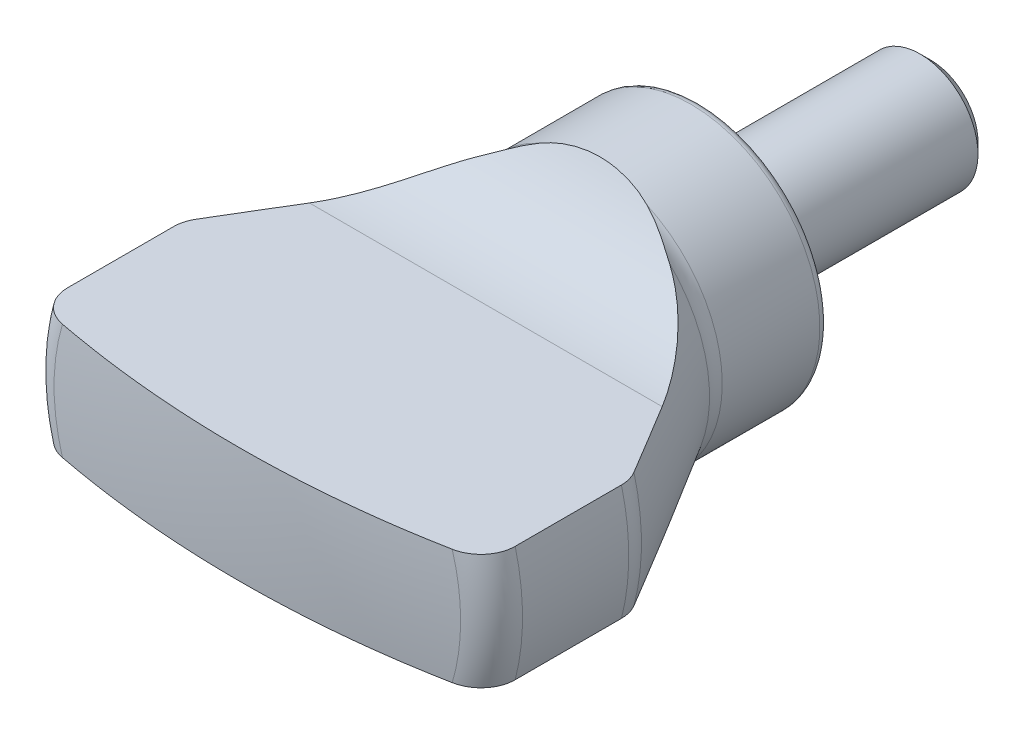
ISO-10303-21;
HEADER;
FILE_DESCRIPTION(('STEP AP214'),'2;1');
FILE_NAME('part.step','',(''),(''),'','','');
FILE_SCHEMA(('AUTOMOTIVE_DESIGN { 1 0 10303 214 1 1 1 1 }'));
ENDSEC;
DATA;
#1=APPLICATION_CONTEXT('core data for automotive mechanical design processes');
#2=APPLICATION_PROTOCOL_DEFINITION('international standard','automotive_design',2000,#1);
#3=PRODUCT_CONTEXT('',#1,'mechanical');
#4=PRODUCT('Part','Part','',(#3));
#5=PRODUCT_RELATED_PRODUCT_CATEGORY('part','',(#4));
#6=PRODUCT_DEFINITION_FORMATION('','',#4);
#7=PRODUCT_DEFINITION_CONTEXT('part definition',#1,'design');
#8=PRODUCT_DEFINITION('design','',#6,#7);
#9=PRODUCT_DEFINITION_SHAPE('','',#8);
#10=(LENGTH_UNIT() NAMED_UNIT(*) SI_UNIT(.MILLI.,.METRE.));
#11=(NAMED_UNIT(*) PLANE_ANGLE_UNIT() SI_UNIT($,.RADIAN.));
#12=(NAMED_UNIT(*) SI_UNIT($,.STERADIAN.) SOLID_ANGLE_UNIT());
#13=UNCERTAINTY_MEASURE_WITH_UNIT(LENGTH_MEASURE(1.E-05),#10,'distance_accuracy_value','');
#14=(GEOMETRIC_REPRESENTATION_CONTEXT(3) GLOBAL_UNCERTAINTY_ASSIGNED_CONTEXT((#13)) GLOBAL_UNIT_ASSIGNED_CONTEXT((#10,
#11,#12)) REPRESENTATION_CONTEXT('',''));
#15=CARTESIAN_POINT('',(0.,0.,0.));
#16=DIRECTION('',(0.,0.,1.));
#17=DIRECTION('',(1.,0.,0.));
#18=AXIS2_PLACEMENT_3D('',#15,#16,#17);
#19=CARTESIAN_POINT('',(1.0842021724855E-13,0.,-49.9999999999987));
#20=DIRECTION('',(0.,0.,-1.));
#21=DIRECTION('',(1.,0.,0.));
#22=AXIS2_PLACEMENT_3D('',#19,#20,#21);
#23=SPHERICAL_SURFACE('',#22,89.9999999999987);
#24=CARTESIAN_POINT('',(0.,0.,38.2650855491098));
#25=DIRECTION('',(0.,0.,-1.));
#26=DIRECTION('',(0.,1.,0.));
#27=AXIS2_PLACEMENT_3D('',#24,#25,#26);
#28=CIRCLE('',#27,17.5862068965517);
#29=CARTESIAN_POINT('',(-16.8604469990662,-5.,38.2650855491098));
#30=VERTEX_POINT('',#29);
#31=CARTESIAN_POINT('',(-16.8604469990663,5.,38.2650855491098));
#32=VERTEX_POINT('',#31);
#33=EDGE_CURVE('E322',#30,#32,#28,.T.);
#34=ORIENTED_EDGE('',*,*,#33,.F.);
#35=CARTESIAN_POINT('',(1.0842021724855E-13,-5.,-49.9999999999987));
#36=DIRECTION('',(0.,-1.,0.));
#37=DIRECTION('',(1.,0.,0.));
#38=AXIS2_PLACEMENT_3D('',#35,#36,#37);
#39=CIRCLE('',#38,89.8610037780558);
#40=CARTESIAN_POINT('',(16.8604469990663,-5.,38.2650855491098));
#41=VERTEX_POINT('',#40);
#42=EDGE_CURVE('E280',#30,#41,#39,.F.);
#43=ORIENTED_EDGE('',*,*,#42,.T.);
#44=CARTESIAN_POINT('',(16.8604469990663,5.,38.2650855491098));
#45=VERTEX_POINT('',#44);
#46=EDGE_CURVE('E323',#45,#41,#28,.T.);
#47=ORIENTED_EDGE('',*,*,#46,.F.);
#48=CARTESIAN_POINT('',(1.0842021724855E-13,5.,-49.9999999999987));
#49=DIRECTION('',(0.,1.,0.));
#50=DIRECTION('',(-1.,0.,0.));
#51=AXIS2_PLACEMENT_3D('',#48,#49,#50);
#52=CIRCLE('',#51,89.8610037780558);
#53=EDGE_CURVE('E302',#45,#32,#52,.F.);
#54=ORIENTED_EDGE('',*,*,#53,.T.);
#55=EDGE_LOOP('',(#34,#43,#47,#54));
#56=FACE_BOUND('',#55,.T.);
#57=ADVANCED_FACE('F14',(#56),#23,.T.);
#58=CARTESIAN_POINT('',(0.,0.,35.3229160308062));
#59=DIRECTION('',(0.,0.,-1.));
#60=DIRECTION('',(0.,1.,0.));
#61=AXIS2_PLACEMENT_3D('',#58,#59,#60);
#62=TOROIDAL_SURFACE('',#61,17.,3.);
#63=CARTESIAN_POINT('',(0.,0.,35.3229160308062));
#64=DIRECTION('',(0.,0.,-1.));
#65=DIRECTION('',(0.,1.,0.));
#66=AXIS2_PLACEMENT_3D('',#63,#64,#65);
#67=CIRCLE('',#66,20.);
#68=CARTESIAN_POINT('',(-19.3649167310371,-5.,35.3229160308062));
#69=VERTEX_POINT('',#68);
#70=CARTESIAN_POINT('',(-19.3649167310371,5.,35.3229160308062));
#71=VERTEX_POINT('',#70);
#72=EDGE_CURVE('E319',#69,#71,#67,.T.);
#73=ORIENTED_EDGE('',*,*,#72,.F.);
#74=CARTESIAN_POINT('',(-18.9063688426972,-5.,36.8929734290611));
#75=CARTESIAN_POINT('',(-18.8144407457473,-5.,37.0376580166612));
#76=CARTESIAN_POINT('',(-18.7098980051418,-5.,37.1745088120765));
#77=CARTESIAN_POINT('',(-18.4790307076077,-5.,37.4286369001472));
#78=CARTESIAN_POINT('',(-18.3526717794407,-5.,37.54588272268));
#79=CARTESIAN_POINT('',(-18.0824634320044,-5.,37.7574719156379));
#80=CARTESIAN_POINT('',(-17.9386491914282,-5.,37.851860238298));
#81=CARTESIAN_POINT('',(-17.637614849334,-5.,38.0158576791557));
#82=CARTESIAN_POINT('',(-17.4803981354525,-5.,38.0854730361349));
#83=CARTESIAN_POINT('',(-17.152430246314,-5.,38.200143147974));
#84=CARTESIAN_POINT('',(-16.9814268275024,-5.,38.2444759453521));
#85=CARTESIAN_POINT('',(-16.6344892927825,-5.,38.3048538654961));
#86=CARTESIAN_POINT('',(-16.4585540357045,-5.,38.3208923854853));
#87=CARTESIAN_POINT('',(-16.1003505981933,-5.,38.3246425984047));
#88=CARTESIAN_POINT('',(-15.9180717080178,-5.,38.311366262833));
#89=CARTESIAN_POINT('',(-15.5581738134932,-5.,38.2549746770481));
#90=CARTESIAN_POINT('',(-15.3805555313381,-5.,38.211854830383));
#91=CARTESIAN_POINT('',(-15.0317950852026,-5.,38.0958440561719));
#92=CARTESIAN_POINT('',(-14.8608232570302,-5.,38.0224395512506));
#93=CARTESIAN_POINT('',(-14.5338396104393,-5.,37.8475815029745));
#94=CARTESIAN_POINT('',(-14.3778279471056,-5.,37.7461276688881));
#95=CARTESIAN_POINT('',(-14.0879036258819,-5.,37.5192131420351));
#96=CARTESIAN_POINT('',(-13.953707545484,-5.,37.3941154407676));
#97=CARTESIAN_POINT('',(-13.7095642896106,-5.,37.1221193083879));
#98=CARTESIAN_POINT('',(-13.5996098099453,-5.,36.9752274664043));
#99=CARTESIAN_POINT('',(-13.4132214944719,-5.,36.6715623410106));
#100=CARTESIAN_POINT('',(-13.3353868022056,-5.,36.5156500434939));
#101=CARTESIAN_POINT('',(-13.208973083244,-5.,36.1923891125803));
#102=CARTESIAN_POINT('',(-13.1603805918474,-5.,36.0250457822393));
#103=CARTESIAN_POINT('',(-13.0967199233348,-5.,35.6947620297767));
#104=CARTESIAN_POINT('',(-13.0797781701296,-5.,35.5321811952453));
#105=CARTESIAN_POINT('',(-13.0743857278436,-5.,35.2065635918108));
#106=CARTESIAN_POINT('',(-13.0859289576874,-5.,35.0435269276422));
#107=CARTESIAN_POINT('',(-13.1361982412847,-5.,34.7268418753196));
#108=CARTESIAN_POINT('',(-13.1740842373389,-5.,34.5730588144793));
#109=CARTESIAN_POINT('',(-13.2746199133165,-5.,34.2738337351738));
#110=CARTESIAN_POINT('',(-13.3372712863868,-5.,34.1283922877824));
#111=CARTESIAN_POINT('',(-13.4866025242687,-5.,33.8465389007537));
#112=CARTESIAN_POINT('',(-13.573757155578,-5.,33.7103791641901));
#113=CARTESIAN_POINT('',(-13.7685538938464,-5.,33.4536229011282));
#114=CARTESIAN_POINT('',(-13.8762007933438,-5.,33.3330300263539));
#115=CARTESIAN_POINT('',(-14.1152428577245,-5.,33.1036952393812));
#116=CARTESIAN_POINT('',(-14.2476238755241,-5.,32.9959812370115));
#117=CARTESIAN_POINT('',(-14.5277763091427,-5.,32.8028897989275));
#118=CARTESIAN_POINT('',(-14.6755519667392,-5.,32.7175185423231));
#119=CARTESIAN_POINT('',(-14.9912215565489,-5.,32.5666995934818));
#120=CARTESIAN_POINT('',(-15.1597790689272,-5.,32.5026385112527));
#121=CARTESIAN_POINT('',(-15.5050809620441,-5.,32.4027933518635));
#122=CARTESIAN_POINT('',(-15.6818269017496,-5.,32.3670146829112));
#123=CARTESIAN_POINT('',(-16.0440786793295,-5.,32.3240545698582));
#124=CARTESIAN_POINT('',(-16.2296891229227,-5.,32.3177478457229));
#125=CARTESIAN_POINT('',(-16.5993325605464,-5.,32.3365322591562));
#126=CARTESIAN_POINT('',(-16.7833655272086,-5.,32.3616239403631));
#127=CARTESIAN_POINT('',(-17.1435505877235,-5.,32.4427057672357));
#128=CARTESIAN_POINT('',(-17.319737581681,-5.,32.4985402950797));
#129=CARTESIAN_POINT('',(-17.6597930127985,-5.,32.6398906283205));
#130=CARTESIAN_POINT('',(-17.8236632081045,-5.,32.7254021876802));
#131=CARTESIAN_POINT('',(-18.1291332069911,-5.,32.921076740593));
#132=CARTESIAN_POINT('',(-18.2712498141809,-5.,33.0304323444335));
#133=CARTESIAN_POINT('',(-18.534191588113,-5.,33.2723050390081));
#134=CARTESIAN_POINT('',(-18.6550213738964,-5.,33.4048170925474));
#135=CARTESIAN_POINT('',(-18.8671276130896,-5.,33.6838556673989));
#136=CARTESIAN_POINT('',(-18.9593453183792,-5.,33.829666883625));
#137=CARTESIAN_POINT('',(-19.1170616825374,-5.,34.1350813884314));
#138=CARTESIAN_POINT('',(-19.1825667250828,-5.,34.2946813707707));
#139=CARTESIAN_POINT('',(-19.2829675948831,-5.,34.6177183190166));
#140=CARTESIAN_POINT('',(-19.3187617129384,-5.,34.7808765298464));
#141=CARTESIAN_POINT('',(-19.3619449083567,-5.,35.1109547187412));
#142=CARTESIAN_POINT('',(-19.3693295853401,-5.,35.2778752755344));
#143=CARTESIAN_POINT('',(-19.3555506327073,-5.,35.607820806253));
#144=CARTESIAN_POINT('',(-19.3348427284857,-5.,35.7708653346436));
#145=CARTESIAN_POINT('',(-19.2663712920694,-5.,36.0910101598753));
#146=CARTESIAN_POINT('',(-19.2186437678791,-5.,36.2481180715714));
#147=CARTESIAN_POINT('',(-19.124109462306,-5.,36.4859285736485));
#148=CARTESIAN_POINT('',(-19.0859191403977,-5.,36.5701598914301));
#149=CARTESIAN_POINT('',(-19.0018310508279,-5.,36.7346776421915));
#150=CARTESIAN_POINT('',(-18.9559334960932,-5.,36.814964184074));
#151=CARTESIAN_POINT('',(-18.9063688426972,-5.,36.8929734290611));
#152=B_SPLINE_CURVE_WITH_KNOTS('',3,(#74,#75,#76,#77,#78,#79,#80,#81,#82,#83,#84,#85,#86,#87,
#88,#89,#90,#91,#92,#93,#94,#95,#96,#97,#98,#99,#100,#101,#102,#103,#104,#105,#106,#107,#108,
#109,#110,#111,#112,#113,#114,#115,#116,#117,#118,#119,#120,#121,#122,#123,#124,#125,#126,#127,
#128,#129,#130,#131,#132,#133,#134,#135,#136,#137,#138,#139,#140,#141,#142,#143,#144,#145,#146,
#147,#148,#149,#150,#151),.UNSPECIFIED.,.T.,.F.,(4,2,2,2,2,2,2,2,2,2,2,2,2,2,2,2,2,2,2,2,2,2,2,
2,2,2,2,2,2,2,2,2,2,2,2,2,2,2,4),(0.,0.513904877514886,1.02862692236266,1.5423283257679,
2.05590026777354,2.58348492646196,3.11119268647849,3.65695687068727,4.20280513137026,
4.75831757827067,5.31383578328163,5.86143181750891,6.40886263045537,6.92892893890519,
7.44875559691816,7.93669554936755,8.42453134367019,8.89748388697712,9.37046877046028,
9.85333766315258,10.336319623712,10.8460826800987,11.3559865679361,11.8944998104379,
12.4331160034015,12.9876207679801,13.5421351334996,14.0938680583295,14.645522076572,
15.1807954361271,15.7159525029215,16.2309648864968,16.7458541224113,17.2445418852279,
17.7433068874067,18.2340767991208,18.7241942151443,19.0012827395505,19.2783636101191),.UNSPECIFIED.);
#153=EDGE_CURVE('E332',#69,#30,#152,.T.);
#154=ORIENTED_EDGE('',*,*,#153,.T.);
#155=ORIENTED_EDGE('',*,*,#33,.T.);
#156=CARTESIAN_POINT('',(-18.9063688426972,5.,36.8929734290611));
#157=CARTESIAN_POINT('',(-18.9946474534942,5.,36.7540041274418));
#158=CARTESIAN_POINT('',(-19.0714229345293,5.,36.6076071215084));
#159=CARTESIAN_POINT('',(-19.1994432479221,5.,36.3039220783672));
#160=CARTESIAN_POINT('',(-19.2506648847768,5.,36.1466242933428));
#161=CARTESIAN_POINT('',(-19.3258375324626,5.,35.8255896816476));
#162=CARTESIAN_POINT('',(-19.3497835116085,5.,35.6618516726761));
#163=CARTESIAN_POINT('',(-19.3695737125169,5.,35.3327194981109));
#164=CARTESIAN_POINT('',(-19.3654238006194,5.,35.1673256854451));
#165=CARTESIAN_POINT('',(-19.329330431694,5.,34.840995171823));
#166=CARTESIAN_POINT('',(-19.2976174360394,5.,34.6800329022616));
#167=CARTESIAN_POINT('',(-19.2077474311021,5.,34.365675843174));
#168=CARTESIAN_POINT('',(-19.149589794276,5.,34.2122812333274));
#169=CARTESIAN_POINT('',(-19.0083305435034,5.,33.9164957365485));
#170=CARTESIAN_POINT('',(-18.9251032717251,5.,33.7741649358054));
#171=CARTESIAN_POINT('',(-18.7364116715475,5.,33.5051146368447));
#172=CARTESIAN_POINT('',(-18.6309455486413,5.,33.378396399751));
#173=CARTESIAN_POINT('',(-18.3984276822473,5.,33.1411524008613));
#174=CARTESIAN_POINT('',(-18.2709583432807,5.,33.0310362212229));
#175=CARTESIAN_POINT('',(-17.9998516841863,5.,32.832953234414));
#176=CARTESIAN_POINT('',(-17.8562120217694,5.,32.7449896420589));
#177=CARTESIAN_POINT('',(-17.5517724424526,5.,32.590556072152));
#178=CARTESIAN_POINT('',(-17.3905606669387,5.,32.5248983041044));
#179=CARTESIAN_POINT('',(-17.059647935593,5.,32.42051662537));
#180=CARTESIAN_POINT('',(-16.889945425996,5.,32.3817976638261));
#181=CARTESIAN_POINT('',(-16.5402990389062,5.,32.330986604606));
#182=CARTESIAN_POINT('',(-16.3602070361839,5.,32.3199123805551));
#183=CARTESIAN_POINT('',(-16.0006242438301,5.,32.3273133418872));
#184=CARTESIAN_POINT('',(-15.8211335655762,5.,32.3457937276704));
#185=CARTESIAN_POINT('',(-15.4628588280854,5.,32.412571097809));
#186=CARTESIAN_POINT('',(-15.2842185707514,5.,32.4616424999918));
#187=CARTESIAN_POINT('',(-14.937664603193,5.,32.589046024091));
#188=CARTESIAN_POINT('',(-14.7697518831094,5.,32.6673808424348));
#189=CARTESIAN_POINT('',(-14.4496046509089,5.,32.851519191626));
#190=CARTESIAN_POINT('',(-14.2973760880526,5.,32.9573330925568));
#191=CARTESIAN_POINT('',(-14.0136754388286,5.,33.1939063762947));
#192=CARTESIAN_POINT('',(-13.8822000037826,5.,33.3246617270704));
#193=CARTESIAN_POINT('',(-13.6492292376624,5.,33.6025575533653));
#194=CARTESIAN_POINT('',(-13.5468152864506,5.,33.7489264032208));
#195=CARTESIAN_POINT('',(-13.3699136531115,5.,34.0576730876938));
#196=CARTESIAN_POINT('',(-13.2954134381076,5.,34.2200436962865));
#197=CARTESIAN_POINT('',(-13.1813212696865,5.,34.5454196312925));
#198=CARTESIAN_POINT('',(-13.139863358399,5.,34.7077710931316));
#199=CARTESIAN_POINT('',(-13.0863287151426,5.,35.0372350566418));
#200=CARTESIAN_POINT('',(-13.0742419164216,5.,35.2043459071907));
#201=CARTESIAN_POINT('',(-13.0798460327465,5.,35.5300484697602));
#202=CARTESIAN_POINT('',(-13.0961432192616,5.,35.6886661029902));
#203=CARTESIAN_POINT('',(-13.1551628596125,5.,36.0008871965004));
#204=CARTESIAN_POINT('',(-13.1978844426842,5.,36.1544908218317));
#205=CARTESIAN_POINT('',(-13.3080483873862,5.,36.4525172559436));
#206=CARTESIAN_POINT('',(-13.3754901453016,5.,36.5969402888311));
#207=CARTESIAN_POINT('',(-13.5326508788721,5.,36.8730863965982));
#208=CARTESIAN_POINT('',(-13.6223738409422,5.,37.0048071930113));
#209=CARTESIAN_POINT('',(-13.8257042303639,5.,37.2582461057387));
#210=CARTESIAN_POINT('',(-13.9402056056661,5.,37.3792462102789));
#211=CARTESIAN_POINT('',(-14.1868677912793,5.,37.6016470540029));
#212=CARTESIAN_POINT('',(-14.3190334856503,5.,37.7030423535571));
#213=CARTESIAN_POINT('',(-14.6057713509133,5.,37.889673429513));
#214=CARTESIAN_POINT('',(-14.7612117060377,5.,37.9735763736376));
#215=CARTESIAN_POINT('',(-15.0835521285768,5.,38.1153363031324));
#216=CARTESIAN_POINT('',(-15.2504549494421,5.,38.1731870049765));
#217=CARTESIAN_POINT('',(-15.5986326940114,5.,38.2634374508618));
#218=CARTESIAN_POINT('',(-15.7802169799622,5.,38.2946481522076));
#219=CARTESIAN_POINT('',(-16.1460567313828,5.,38.3264485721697));
#220=CARTESIAN_POINT('',(-16.330312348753,5.,38.3270365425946));
#221=CARTESIAN_POINT('',(-16.6979200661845,5.,38.2971752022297));
#222=CARTESIAN_POINT('',(-16.8812506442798,5.,38.2664579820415));
#223=CARTESIAN_POINT('',(-17.2399845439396,5.,38.1739897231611));
#224=CARTESIAN_POINT('',(-17.4153865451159,5.,38.1122335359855));
#225=CARTESIAN_POINT('',(-17.7491558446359,5.,37.9606247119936));
#226=CARTESIAN_POINT('',(-17.9078035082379,5.,37.8713892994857));
#227=CARTESIAN_POINT('',(-18.2069463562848,5.,37.6666498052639));
#228=CARTESIAN_POINT('',(-18.3474675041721,5.,37.5511839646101));
#229=CARTESIAN_POINT('',(-18.5579403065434,5.,37.344196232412));
#230=CARTESIAN_POINT('',(-18.6347911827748,5.,37.2595746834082));
#231=CARTESIAN_POINT('',(-18.778394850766,5.,37.0821504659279));
#232=CARTESIAN_POINT('',(-18.8451479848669,5.,36.9893480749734));
#233=CARTESIAN_POINT('',(-18.9063688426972,5.,36.8929734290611));
#234=B_SPLINE_CURVE_WITH_KNOTS('',3,(#156,#157,#158,#159,#160,#161,#162,#163,#164,#165,#166,
#167,#168,#169,#170,#171,#172,#173,#174,#175,#176,#177,#178,#179,#180,#181,#182,#183,#184,#185,
#186,#187,#188,#189,#190,#191,#192,#193,#194,#195,#196,#197,#198,#199,#200,#201,#202,#203,#204,
#205,#206,#207,#208,#209,#210,#211,#212,#213,#214,#215,#216,#217,#218,#219,#220,#221,#222,#223,
#224,#225,#226,#227,#228,#229,#230,#231,#232,#233),.UNSPECIFIED.,.T.,.F.,(4,2,2,2,2,2,2,2,2,2,2,
2,2,2,2,2,2,2,2,2,2,2,2,2,2,2,2,2,2,2,2,2,2,2,2,2,2,2,4),(0.,0.493506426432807,
0.987460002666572,1.48150468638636,1.97544621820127,2.46529709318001,2.9551595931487,
3.44751951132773,3.93991917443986,4.44297064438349,4.94609507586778,5.46595386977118,
5.98590814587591,6.52474204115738,7.06367075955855,7.61682980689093,8.17003983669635,
8.72345894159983,9.27678865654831,9.8099352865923,10.342842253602,10.8429572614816,
11.3429008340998,11.8189825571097,12.2950485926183,12.7711030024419,13.2472426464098,
13.7448337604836,14.242562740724,14.7701244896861,15.2978134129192,15.8479792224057,
16.3981764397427,16.9531221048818,17.5081598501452,18.0515424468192,18.594137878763,
18.9363941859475,19.2786388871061),.UNSPECIFIED.);
#235=EDGE_CURVE('E289',#32,#71,#234,.T.);
#236=ORIENTED_EDGE('',*,*,#235,.T.);
#237=EDGE_LOOP('',(#73,#154,#155,#236));
#238=FACE_BOUND('',#237,.T.);
#239=ADVANCED_FACE('F282',(#238),#62,.T.);
#240=CARTESIAN_POINT('',(19.3649167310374,5.,35.3229160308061));
#241=VERTEX_POINT('',#240);
#242=CARTESIAN_POINT('',(19.3649167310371,-5.,35.3229160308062));
#243=VERTEX_POINT('',#242);
#244=EDGE_CURVE('E320',#241,#243,#67,.T.);
#245=ORIENTED_EDGE('',*,*,#244,.F.);
#246=CARTESIAN_POINT('',(13.1974242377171,5.,36.1379355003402));
#247=CARTESIAN_POINT('',(13.151659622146,5.,35.9863073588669));
#248=CARTESIAN_POINT('',(13.1185163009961,5.,35.8307729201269));
#249=CARTESIAN_POINT('',(13.0788889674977,5.,35.5162516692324));
#250=CARTESIAN_POINT('',(13.0724247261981,5.,35.357262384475));
#251=CARTESIAN_POINT('',(13.086460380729,5.,35.0405254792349));
#252=CARTESIAN_POINT('',(13.1069515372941,5.,34.8827774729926));
#253=CARTESIAN_POINT('',(13.1740283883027,5.,34.5729725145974));
#254=CARTESIAN_POINT('',(13.2206120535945,5.,34.4209151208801));
#255=CARTESIAN_POINT('',(13.3383149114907,5.,34.1258375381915));
#256=CARTESIAN_POINT('',(13.4095458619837,5.,33.9828620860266));
#257=CARTESIAN_POINT('',(13.5739518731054,5.,33.7101616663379));
#258=CARTESIAN_POINT('',(13.6671312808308,5.,33.580439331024));
#259=CARTESIAN_POINT('',(13.8773707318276,5.,33.3312717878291));
#260=CARTESIAN_POINT('',(13.9953542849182,5.,33.2126065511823));
#261=CARTESIAN_POINT('',(14.2485733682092,5.,32.9954009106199));
#262=CARTESIAN_POINT('',(14.3838137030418,5.,32.8968661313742));
#263=CARTESIAN_POINT('',(14.676365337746,5.,32.7166379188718));
#264=CARTESIAN_POINT('',(14.8345118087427,5.,32.636298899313));
#265=CARTESIAN_POINT('',(15.1616781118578,5.,32.5021190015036));
#266=CARTESIAN_POINT('',(15.3307004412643,5.,32.4482842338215));
#267=CARTESIAN_POINT('',(15.6821413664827,5.,32.3667302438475));
#268=CARTESIAN_POINT('',(15.8648253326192,5.,32.3401497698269));
#269=CARTESIAN_POINT('',(16.2320846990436,5.,32.3178154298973));
#270=CARTESIAN_POINT('',(16.4166602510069,5.,32.3220640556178));
#271=CARTESIAN_POINT('',(16.7835932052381,5.,32.3616964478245));
#272=CARTESIAN_POINT('',(16.9659305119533,5.,32.397267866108));
#273=CARTESIAN_POINT('',(17.3217867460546,5.,32.499248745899));
#274=CARTESIAN_POINT('',(17.4953065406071,5.,32.5656551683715));
#275=CARTESIAN_POINT('',(17.8241722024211,5.,32.7259621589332));
#276=CARTESIAN_POINT('',(17.9798469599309,5.,32.8191871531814));
#277=CARTESIAN_POINT('',(18.27253878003,5.,33.0313930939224));
#278=CARTESIAN_POINT('',(18.4095596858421,5.,33.150368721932));
#279=CARTESIAN_POINT('',(18.6556377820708,5.,33.4059965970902));
#280=CARTESIAN_POINT('',(18.7655392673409,5.,33.5418360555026));
#281=CARTESIAN_POINT('',(18.9599962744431,5.,33.8305894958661));
#282=CARTESIAN_POINT('',(19.0445571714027,5.,33.9834998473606));
#283=CARTESIAN_POINT('',(19.1829244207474,5.,34.296312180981));
#284=CARTESIAN_POINT('',(19.2376957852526,5.,34.4557876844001));
#285=CARTESIAN_POINT('',(19.3190075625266,5.,34.7817776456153));
#286=CARTESIAN_POINT('',(19.345552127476,5.,34.9482910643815));
#287=CARTESIAN_POINT('',(19.3692371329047,5.,35.2796930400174));
#288=CARTESIAN_POINT('',(19.3670127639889,5.,35.4445365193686));
#289=CARTESIAN_POINT('',(19.3347760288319,5.,35.7714752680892));
#290=CARTESIAN_POINT('',(19.3047651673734,5.,35.9335706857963));
#291=CARTESIAN_POINT('',(19.2181496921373,5.,36.2496774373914));
#292=CARTESIAN_POINT('',(19.1616678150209,5.,36.4037224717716));
#293=CARTESIAN_POINT('',(19.0239696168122,5.,36.7003162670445));
#294=CARTESIAN_POINT('',(18.9427523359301,5.,36.842864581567));
#295=CARTESIAN_POINT('',(18.7568757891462,5.,37.1145245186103));
#296=CARTESIAN_POINT('',(18.6519209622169,5.,37.243433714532));
#297=CARTESIAN_POINT('',(18.4223930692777,5.,37.4823896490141));
#298=CARTESIAN_POINT('',(18.2978177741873,5.,37.5924342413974));
#299=CARTESIAN_POINT('',(18.0289390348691,5.,37.793881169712));
#300=CARTESIAN_POINT('',(17.8841824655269,5.,37.8846783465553));
#301=CARTESIAN_POINT('',(17.581895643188,5.,38.0416528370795));
#302=CARTESIAN_POINT('',(17.4243632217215,5.,38.1078259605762));
#303=CARTESIAN_POINT('',(17.0949551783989,5.,38.2161963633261));
#304=CARTESIAN_POINT('',(16.922767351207,5.,38.2574446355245));
#305=CARTESIAN_POINT('',(16.5739838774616,5.,38.3114813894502));
#306=CARTESIAN_POINT('',(16.3973874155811,5.,38.3242645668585));
#307=CARTESIAN_POINT('',(16.0384906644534,5.,38.3212936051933));
#308=CARTESIAN_POINT('',(15.856198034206,5.,38.3045664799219));
#309=CARTESIAN_POINT('',(15.4968574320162,5.,38.2412749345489));
#310=CARTESIAN_POINT('',(15.3198100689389,5.,38.1947070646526));
#311=CARTESIAN_POINT('',(14.9730662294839,5.,38.0719070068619));
#312=CARTESIAN_POINT('',(14.8035347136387,5.,37.9952077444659));
#313=CARTESIAN_POINT('',(14.4799663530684,5.,37.8139665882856));
#314=CARTESIAN_POINT('',(14.3259334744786,5.,37.709417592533));
#315=CARTESIAN_POINT('',(14.0407644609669,5.,37.4768734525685));
#316=CARTESIAN_POINT('',(13.9093033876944,5.,37.3492772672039));
#317=CARTESIAN_POINT('',(13.6712268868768,5.,37.0728726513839));
#318=CARTESIAN_POINT('',(13.5645712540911,5.,36.924099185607));
#319=CARTESIAN_POINT('',(13.4145123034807,5.,36.6679438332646));
#320=CARTESIAN_POINT('',(13.3623091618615,5.,36.5656245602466));
#321=CARTESIAN_POINT('',(13.2703389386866,5.,36.3555315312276));
#322=CARTESIAN_POINT('',(13.2305710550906,5.,36.2477581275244));
#323=CARTESIAN_POINT('',(13.1974242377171,5.,36.1379355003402));
#324=B_SPLINE_CURVE_WITH_KNOTS('',3,(#246,#247,#248,#249,#250,#251,#252,#253,#254,#255,#256,
#257,#258,#259,#260,#261,#262,#263,#264,#265,#266,#267,#268,#269,#270,#271,#272,#273,#274,#275,
#276,#277,#278,#279,#280,#281,#282,#283,#284,#285,#286,#287,#288,#289,#290,#291,#292,#293,#294,
#295,#296,#297,#298,#299,#300,#301,#302,#303,#304,#305,#306,#307,#308,#309,#310,#311,#312,#313,
#314,#315,#316,#317,#318,#319,#320,#321,#322,#323),.UNSPECIFIED.,.T.,.F.,(4,2,2,2,2,2,2,2,2,2,2,
2,2,2,2,2,2,2,2,2,2,2,2,2,2,2,2,2,2,2,2,2,2,2,2,2,2,2,4),(0.,0.474741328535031,
0.949834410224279,1.42477349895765,1.89967565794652,2.37676000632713,2.85393892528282,
3.35376529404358,3.85373112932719,4.38350643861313,4.91340383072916,5.46463623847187,
6.01591319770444,6.57051544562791,7.12506304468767,7.66670946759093,8.20824412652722,
8.72982639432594,9.25129794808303,9.75468180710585,10.2579916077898,10.7502081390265,
11.2423980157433,11.73232802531,12.2222770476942,12.718699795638,13.2151789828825,
13.7254975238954,14.235902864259,14.7646848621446,15.2935653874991,15.8402109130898,
16.3869196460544,16.9424604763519,17.4981431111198,18.0449959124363,18.5909560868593,
18.9348282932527,19.2786783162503),.UNSPECIFIED.);
#325=EDGE_CURVE('E296',#241,#45,#324,.T.);
#326=ORIENTED_EDGE('',*,*,#325,.T.);
#327=ORIENTED_EDGE('',*,*,#46,.T.);
#328=CARTESIAN_POINT('',(13.1974242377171,-5.,36.1379355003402));
#329=CARTESIAN_POINT('',(13.2458549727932,-5.,36.2983364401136));
#330=CARTESIAN_POINT('',(13.3084926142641,-5.,36.4546148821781));
#331=CARTESIAN_POINT('',(13.4596100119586,-5.,36.7543221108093));
#332=CARTESIAN_POINT('',(13.5481363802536,-5.,36.8977271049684));
#333=CARTESIAN_POINT('',(13.7474060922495,-5.,37.167462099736));
#334=CARTESIAN_POINT('',(13.8580817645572,-5.,37.2938421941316));
#335=CARTESIAN_POINT('',(14.0981857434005,-5.,37.5271717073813));
#336=CARTESIAN_POINT('',(14.2276097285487,-5.,37.6341255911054));
#337=CARTESIAN_POINT('',(14.5077094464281,-5.,37.8308229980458));
#338=CARTESIAN_POINT('',(14.6590777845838,-5.,37.9195800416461));
#339=CARTESIAN_POINT('',(14.9740768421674,-5.,38.0717380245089));
#340=CARTESIAN_POINT('',(15.1377111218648,-5.,38.1351315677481));
#341=CARTESIAN_POINT('',(15.4807148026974,-5.,38.2374949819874));
#342=CARTESIAN_POINT('',(15.6604618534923,-5.,38.2752033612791));
#343=CARTESIAN_POINT('',(16.0237341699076,-5.,38.3203418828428));
#344=CARTESIAN_POINT('',(16.2072598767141,-5.,38.3277684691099));
#345=CARTESIAN_POINT('',(16.5753197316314,-5.,38.3118107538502));
#346=CARTESIAN_POINT('',(16.7598373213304,-5.,38.2880359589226));
#347=CARTESIAN_POINT('',(17.1220971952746,-5.,38.2092489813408));
#348=CARTESIAN_POINT('',(17.2998399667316,-5.,38.1542390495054));
#349=CARTESIAN_POINT('',(17.6398217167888,-5.,38.0154081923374));
#350=CARTESIAN_POINT('',(17.8022891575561,-5.,37.9321476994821));
#351=CARTESIAN_POINT('',(18.1102312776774,-5.,37.7385677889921));
#352=CARTESIAN_POINT('',(18.2557092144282,-5.,37.6282535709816));
#353=CARTESIAN_POINT('',(18.5199601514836,-5.,37.3878820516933));
#354=CARTESIAN_POINT('',(18.6394994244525,-5.,37.2586673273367));
#355=CARTESIAN_POINT('',(18.8542013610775,-5.,36.9813570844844));
#356=CARTESIAN_POINT('',(18.9493693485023,-5.,36.8332657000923));
#357=CARTESIAN_POINT('',(19.1090590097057,-5.,36.5281914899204));
#358=CARTESIAN_POINT('',(19.1745625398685,-5.,36.3717222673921));
#359=CARTESIAN_POINT('',(19.2776065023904,-5.,36.0498335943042));
#360=CARTESIAN_POINT('',(19.3151514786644,-5.,35.884415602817));
#361=CARTESIAN_POINT('',(19.3604094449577,-5.,35.5537664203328));
#362=CARTESIAN_POINT('',(19.3688434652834,-5.,35.3886335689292));
#363=CARTESIAN_POINT('',(19.3576194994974,-5.,35.0593326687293));
#364=CARTESIAN_POINT('',(19.3379635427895,-5.,34.8951645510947));
#365=CARTESIAN_POINT('',(19.271488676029,-5.,34.5738133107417));
#366=CARTESIAN_POINT('',(19.2248891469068,-5.,34.4165846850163));
#367=CARTESIAN_POINT('',(19.1062079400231,-5.,34.1120709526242));
#368=CARTESIAN_POINT('',(19.0341257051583,-5.,33.9647860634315));
#369=CARTESIAN_POINT('',(18.8659025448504,-5.,33.6826761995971));
#370=CARTESIAN_POINT('',(18.769528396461,-5.,33.5479904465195));
#371=CARTESIAN_POINT('',(18.5560558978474,-5.,33.2962068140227));
#372=CARTESIAN_POINT('',(18.4389554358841,-5.,33.1791107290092));
#373=CARTESIAN_POINT('',(18.1842402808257,-5.,32.9625638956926));
#374=CARTESIAN_POINT('',(18.0461786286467,-5.,32.8636392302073));
#375=CARTESIAN_POINT('',(17.7558677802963,-5.,32.6894581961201));
#376=CARTESIAN_POINT('',(17.6036163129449,-5.,32.6142056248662));
#377=CARTESIAN_POINT('',(17.2835544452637,-5.,32.4866803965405));
#378=CARTESIAN_POINT('',(17.1153852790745,-5.,32.4353083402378));
#379=CARTESIAN_POINT('',(16.7729526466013,-5.,32.3604668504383));
#380=CARTESIAN_POINT('',(16.5986880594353,-5.,32.3370025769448));
#381=CARTESIAN_POINT('',(16.2425054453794,-5.,32.3179045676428));
#382=CARTESIAN_POINT('',(16.0605332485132,-5.,32.3232751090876));
#383=CARTESIAN_POINT('',(15.6999264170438,-5.,32.3638185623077));
#384=CARTESIAN_POINT('',(15.5212923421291,-5.,32.3989964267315));
#385=CARTESIAN_POINT('',(15.168574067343,-5.,32.4992574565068));
#386=CARTESIAN_POINT('',(14.9946618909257,-5.,32.5649476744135));
#387=CARTESIAN_POINT('',(14.6604438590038,-5.,32.7248460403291));
#388=CARTESIAN_POINT('',(14.5001385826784,-5.,32.8190554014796));
#389=CARTESIAN_POINT('',(14.1996005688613,-5.,33.032769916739));
#390=CARTESIAN_POINT('',(14.0591938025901,-5.,33.1520297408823));
#391=CARTESIAN_POINT('',(13.8015808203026,-5.,33.4134434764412));
#392=CARTESIAN_POINT('',(13.6843676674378,-5.,33.5555905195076));
#393=CARTESIAN_POINT('',(13.4825515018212,-5.,33.8518892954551));
#394=CARTESIAN_POINT('',(13.3966941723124,-5.,34.0051854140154));
#395=CARTESIAN_POINT('',(13.2538963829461,-5.,34.3247585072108));
#396=CARTESIAN_POINT('',(13.1969506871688,-5.,34.4910331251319));
#397=CARTESIAN_POINT('',(13.1171769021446,-5.,34.8206856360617));
#398=CARTESIAN_POINT('',(13.0924601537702,-5.,34.9836090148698));
#399=CARTESIAN_POINT('',(13.0719418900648,-5.,35.311101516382));
#400=CARTESIAN_POINT('',(13.0760928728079,-5.,35.4756674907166));
#401=CARTESIAN_POINT('',(13.1040817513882,-5.,35.7230523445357));
#402=CARTESIAN_POINT('',(13.1175078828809,-5.,35.8071755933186));
#403=CARTESIAN_POINT('',(13.1518751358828,-5.,35.9738657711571));
#404=CARTESIAN_POINT('',(13.1728156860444,-5.,36.056432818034));
#405=CARTESIAN_POINT('',(13.1974242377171,-5.,36.1379355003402));
#406=B_SPLINE_CURVE_WITH_KNOTS('',3,(#328,#329,#330,#331,#332,#333,#334,#335,#336,#337,#338,
#339,#340,#341,#342,#343,#344,#345,#346,#347,#348,#349,#350,#351,#352,#353,#354,#355,#356,#357,
#358,#359,#360,#361,#362,#363,#364,#365,#366,#367,#368,#369,#370,#371,#372,#373,#374,#375,#376,
#377,#378,#379,#380,#381,#382,#383,#384,#385,#386,#387,#388,#389,#390,#391,#392,#393,#394,#395,
#396,#397,#398,#399,#400,#401,#402,#403,#404,#405),.UNSPECIFIED.,.T.,.F.,(4,2,2,2,2,2,2,2,2,2,2,
2,2,2,2,2,2,2,2,2,2,2,2,2,2,2,2,2,2,2,2,2,2,2,2,2,2,2,4),(0.,0.502325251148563,1.00556055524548,
1.50728120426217,2.00888639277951,2.53297837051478,3.05722306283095,3.60564991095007,
4.15414115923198,4.70956281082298,5.26494444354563,5.80989671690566,6.35474433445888,
6.8801970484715,7.40553488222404,7.91191799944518,8.41821879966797,8.9118856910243,
9.40551691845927,9.89518437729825,10.3848625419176,10.8794341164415,11.37405611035,
11.8812906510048,12.388606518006,12.9137523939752,13.4389953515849,13.9826479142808,
14.5263908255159,15.0814482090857,15.6365292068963,16.1864083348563,16.7361227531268,
17.2604930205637,17.784768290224,18.2766882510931,18.7677989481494,19.0230590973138,
19.2782998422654),.UNSPECIFIED.);
#407=EDGE_CURVE('E274',#41,#243,#406,.T.);
#408=ORIENTED_EDGE('',*,*,#407,.T.);
#409=EDGE_LOOP('',(#245,#326,#327,#408));
#410=FACE_BOUND('',#409,.T.);
#411=ADVANCED_FACE('F285',(#410),#62,.T.);
#412=CARTESIAN_POINT('',(0.,0.,0.));
#413=DIRECTION('',(0.,0.,-1.));
#414=DIRECTION('',(0.,1.,0.));
#415=AXIS2_PLACEMENT_3D('',#412,#413,#414);
#416=CYLINDRICAL_SURFACE('',#415,20.);
#417=DIRECTION('',(0.,0.,-1.));
#418=VECTOR('',#417,1.);
#419=CARTESIAN_POINT('',(-19.3649167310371,-5.,0.));
#420=LINE('',#419,#418);
#421=CARTESIAN_POINT('',(-19.3649167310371,-5.,26.132497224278));
#422=VERTEX_POINT('',#421);
#423=EDGE_CURVE('E347',#69,#422,#420,.T.);
#424=ORIENTED_EDGE('',*,*,#423,.F.);
#425=ORIENTED_EDGE('',*,*,#72,.T.);
#426=DIRECTION('',(0.,0.,-1.));
#427=VECTOR('',#426,1.);
#428=CARTESIAN_POINT('',(-19.3649167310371,5.,0.));
#429=LINE('',#428,#427);
#430=CARTESIAN_POINT('',(-19.3649167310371,5.,26.132497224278));
#431=VERTEX_POINT('',#430);
#432=EDGE_CURVE('E246',#431,#71,#429,.F.);
#433=ORIENTED_EDGE('',*,*,#432,.F.);
#434=CARTESIAN_POINT('',(0.,0.,26.132497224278));
#435=DIRECTION('',(0.,0.,-1.));
#436=DIRECTION('',(0.,1.,0.));
#437=AXIS2_PLACEMENT_3D('',#434,#435,#436);
#438=CIRCLE('',#437,20.);
#439=EDGE_CURVE('E310',#422,#431,#438,.T.);
#440=ORIENTED_EDGE('',*,*,#439,.F.);
#441=EDGE_LOOP('',(#424,#425,#433,#440));
#442=FACE_BOUND('',#441,.T.);
#443=ADVANCED_FACE('F255',(#442),#416,.T.);
#444=DIRECTION('',(0.,0.,-1.));
#445=VECTOR('',#444,1.);
#446=CARTESIAN_POINT('',(19.3649167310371,5.,0.));
#447=LINE('',#446,#445);
#448=CARTESIAN_POINT('',(19.3649167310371,5.,26.132497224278));
#449=VERTEX_POINT('',#448);
#450=EDGE_CURVE('E301',#241,#449,#447,.T.);
#451=ORIENTED_EDGE('',*,*,#450,.F.);
#452=ORIENTED_EDGE('',*,*,#244,.T.);
#453=DIRECTION('',(0.,0.,-1.));
#454=VECTOR('',#453,1.);
#455=CARTESIAN_POINT('',(19.3649167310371,-5.,0.));
#456=LINE('',#455,#454);
#457=CARTESIAN_POINT('',(19.3649167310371,-5.,26.132497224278));
#458=VERTEX_POINT('',#457);
#459=EDGE_CURVE('E272',#458,#243,#456,.F.);
#460=ORIENTED_EDGE('',*,*,#459,.F.);
#461=EDGE_CURVE('E307',#449,#458,#438,.T.);
#462=ORIENTED_EDGE('',*,*,#461,.F.);
#463=EDGE_LOOP('',(#451,#452,#460,#462));
#464=FACE_BOUND('',#463,.T.);
#465=ADVANCED_FACE('F253',(#464),#416,.T.);
#466=CARTESIAN_POINT('',(0.,0.,26.132497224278));
#467=DIRECTION('',(0.,0.,-1.));
#468=DIRECTION('',(0.,1.,0.));
#469=AXIS2_PLACEMENT_3D('',#466,#467,#468);
#470=TOROIDAL_SURFACE('',#469,17.,3.);
#471=CARTESIAN_POINT('',(0.,0.,24.632497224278));
#472=DIRECTION('',(0.,0.,-1.));
#473=DIRECTION('',(0.,1.,0.));
#474=AXIS2_PLACEMENT_3D('',#471,#472,#473);
#475=CIRCLE('',#474,19.5980762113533);
#476=CARTESIAN_POINT('',(-18.949527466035,-5.,24.632497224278));
#477=VERTEX_POINT('',#476);
#478=CARTESIAN_POINT('',(-18.949527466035,5.,24.632497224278));
#479=VERTEX_POINT('',#478);
#480=EDGE_CURVE('E311',#477,#479,#475,.T.);
#481=ORIENTED_EDGE('',*,*,#480,.F.);
#482=CARTESIAN_POINT('',(-19.2214978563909,-5.,25.230433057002));
#483=CARTESIAN_POINT('',(-19.2721403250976,-5.,25.3859109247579));
#484=CARTESIAN_POINT('',(-19.3097573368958,-5.,25.5457481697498));
#485=CARTESIAN_POINT('',(-19.3576259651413,-5.,25.8695917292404));
#486=CARTESIAN_POINT('',(-19.3678490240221,-5.,26.0336022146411));
#487=CARTESIAN_POINT('',(-19.3605395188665,-5.,26.3609548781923));
#488=CARTESIAN_POINT('',(-19.3430173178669,-5.,26.5242972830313));
#489=CARTESIAN_POINT('',(-19.2808148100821,-5.,26.8456796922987));
#490=CARTESIAN_POINT('',(-19.236140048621,-5.,27.0037207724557));
#491=CARTESIAN_POINT('',(-19.121035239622,-5.,27.3102898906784));
#492=CARTESIAN_POINT('',(-19.0505801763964,-5.,27.458808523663));
#493=CARTESIAN_POINT('',(-18.8861481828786,-5.,27.7421871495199));
#494=CARTESIAN_POINT('',(-18.7921692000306,-5.,27.8770459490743));
#495=CARTESIAN_POINT('',(-18.581698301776,-5.,28.1319111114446));
#496=CARTESIAN_POINT('',(-18.4648380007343,-5.,28.2516130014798));
#497=CARTESIAN_POINT('',(-18.2132129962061,-5.,28.4704062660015));
#498=CARTESIAN_POINT('',(-18.0784459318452,-5.,28.5694949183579));
#499=CARTESIAN_POINT('',(-17.7904304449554,-5.,28.7475694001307));
#500=CARTESIAN_POINT('',(-17.6367395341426,-5.,28.8258392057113));
#501=CARTESIAN_POINT('',(-17.3187337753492,-5.,28.9564980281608));
#502=CARTESIAN_POINT('',(-17.1544170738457,-5.,29.008882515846));
#503=CARTESIAN_POINT('',(-16.8134156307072,-5.,29.088273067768));
#504=CARTESIAN_POINT('',(-16.6364983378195,-5.,29.114280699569));
#505=CARTESIAN_POINT('',(-16.2807865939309,-5.,29.1371827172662));
#506=CARTESIAN_POINT('',(-16.1019918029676,-5.,29.1340717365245));
#507=CARTESIAN_POINT('',(-15.7418294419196,-5.,29.0985007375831));
#508=CARTESIAN_POINT('',(-15.5605493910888,-5.,29.0651496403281));
#509=CARTESIAN_POINT('',(-15.2060317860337,-5.,28.9687754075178));
#510=CARTESIAN_POINT('',(-15.0327952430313,-5.,28.9057485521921));
#511=CARTESIAN_POINT('',(-14.6978816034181,-5.,28.7508473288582));
#512=CARTESIAN_POINT('',(-14.536317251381,-5.,28.6587285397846));
#513=CARTESIAN_POINT('',(-14.2314752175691,-5.,28.4479755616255));
#514=CARTESIAN_POINT('',(-14.0881961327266,-5.,28.3293434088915));
#515=CARTESIAN_POINT('',(-13.828469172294,-5.,28.0720077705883));
#516=CARTESIAN_POINT('',(-13.7114047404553,-5.,27.9339279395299));
#517=CARTESIAN_POINT('',(-13.5038228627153,-5.,27.6390607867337));
#518=CARTESIAN_POINT('',(-13.4132948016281,-5.,27.4822809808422));
#519=CARTESIAN_POINT('',(-13.2670871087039,-5.,27.1641957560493));
#520=CARTESIAN_POINT('',(-13.209691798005,-5.,27.0036793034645));
#521=CARTESIAN_POINT('',(-13.124466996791,-5.,26.6749905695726));
#522=CARTESIAN_POINT('',(-13.0966254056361,-5.,26.5068214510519));
#523=CARTESIAN_POINT('',(-13.0724789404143,-5.,26.177664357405));
#524=CARTESIAN_POINT('',(-13.0745074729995,-5.,26.016796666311));
#525=CARTESIAN_POINT('',(-13.1059705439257,-5.,25.6977819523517));
#526=CARTESIAN_POINT('',(-13.1354021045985,-5.,25.5396346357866));
#527=CARTESIAN_POINT('',(-13.2198436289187,-5.,25.2327087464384));
#528=CARTESIAN_POINT('',(-13.2744957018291,-5.,25.0838311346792));
#529=CARTESIAN_POINT('',(-13.407177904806,-5.,24.7969080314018));
#530=CARTESIAN_POINT('',(-13.4852112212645,-5.,24.6588640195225));
#531=CARTESIAN_POINT('',(-13.6651659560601,-5.,24.3921250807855));
#532=CARTESIAN_POINT('',(-13.7678391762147,-5.,24.2639382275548));
#533=CARTESIAN_POINT('',(-13.9921369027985,-5.,24.0254018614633));
#534=CARTESIAN_POINT('',(-14.1137663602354,-5.,23.915057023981));
#535=CARTESIAN_POINT('',(-14.3802564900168,-5.,23.7084246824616));
#536=CARTESIAN_POINT('',(-14.5260687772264,-5.,23.6133641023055));
#537=CARTESIAN_POINT('',(-14.8309874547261,-5.,23.4477110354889));
#538=CARTESIAN_POINT('',(-14.9900973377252,-5.,23.3771250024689));
#539=CARTESIAN_POINT('',(-15.3255736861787,-5.,23.2590451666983));
#540=CARTESIAN_POINT('',(-15.5024044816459,-5.,23.2128671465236));
#541=CARTESIAN_POINT('',(-15.8612697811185,-5.,23.1502564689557));
#542=CARTESIAN_POINT('',(-16.0433050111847,-5.,23.1338279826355));
#543=CARTESIAN_POINT('',(-16.4108781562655,-5.,23.1312997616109));
#544=CARTESIAN_POINT('',(-16.5964203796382,-5.,23.1457488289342));
#545=CARTESIAN_POINT('',(-16.9623384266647,-5.,23.2060645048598));
#546=CARTESIAN_POINT('',(-17.1427146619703,-5.,23.2519286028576));
#547=CARTESIAN_POINT('',(-17.4901895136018,-5.,23.3733093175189));
#548=CARTESIAN_POINT('',(-17.6574464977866,-5.,23.4483716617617));
#549=CARTESIAN_POINT('',(-17.9763991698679,-5.,23.6264984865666));
#550=CARTESIAN_POINT('',(-18.128093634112,-5.,23.7295651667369));
#551=CARTESIAN_POINT('',(-18.4060133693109,-5.,23.9570729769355));
#552=CARTESIAN_POINT('',(-18.5329246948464,-5.,24.0806766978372));
#553=CARTESIAN_POINT('',(-18.763079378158,-5.,24.3480607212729));
#554=CARTESIAN_POINT('',(-18.8663580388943,-5.,24.491810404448));
#555=CARTESIAN_POINT('',(-19.0108144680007,-5.,24.7360777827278));
#556=CARTESIAN_POINT('',(-19.0605197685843,-5.,24.8316547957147));
#557=CARTESIAN_POINT('',(-19.1491964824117,-5.,25.0276695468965));
#558=CARTESIAN_POINT('',(-19.1881681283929,-5.,25.1281071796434));
#559=CARTESIAN_POINT('',(-19.2214978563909,-5.,25.230433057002));
#560=B_SPLINE_CURVE_WITH_KNOTS('',3,(#482,#483,#484,#485,#486,#487,#488,#489,#490,#491,#492,
#493,#494,#495,#496,#497,#498,#499,#500,#501,#502,#503,#504,#505,#506,#507,#508,#509,#510,#511,
#512,#513,#514,#515,#516,#517,#518,#519,#520,#521,#522,#523,#524,#525,#526,#527,#528,#529,#530,
#531,#532,#533,#534,#535,#536,#537,#538,#539,#540,#541,#542,#543,#544,#545,#546,#547,#548,#549,
#550,#551,#552,#553,#554,#555,#556,#557,#558,#559),.UNSPECIFIED.,.T.,.F.,(4,2,2,2,2,2,2,2,2,2,2,
2,2,2,2,2,2,2,2,2,2,2,2,2,2,2,2,2,2,2,2,2,2,2,2,2,2,2,4),(0.,0.490162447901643,
0.980835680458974,1.47132568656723,1.96171555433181,2.4525825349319,2.9434923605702,
3.44307464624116,3.94272286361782,4.45781470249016,4.97299663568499,5.50702382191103,
6.04114943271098,6.59154439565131,7.14200836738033,7.6972260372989,8.25240107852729,
8.79268616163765,9.33275482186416,9.84152153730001,10.3500798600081,10.8303762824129,
11.3106205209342,11.7842500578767,12.2579441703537,12.7485090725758,13.2392023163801,
13.7590893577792,14.2791133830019,14.824874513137,15.3707121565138,15.9263318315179,
16.4819071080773,17.0291637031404,17.5764632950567,18.1053181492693,18.6333777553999,
18.9559792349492,19.2785737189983),.UNSPECIFIED.);
#561=EDGE_CURVE('E343',#477,#422,#560,.T.);
#562=ORIENTED_EDGE('',*,*,#561,.T.);
#563=ORIENTED_EDGE('',*,*,#439,.T.);
#564=CARTESIAN_POINT('',(-19.2214978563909,5.,25.230433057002));
#565=CARTESIAN_POINT('',(-19.1695902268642,5.,25.0711233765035));
#566=CARTESIAN_POINT('',(-19.1039240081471,5.,24.9161474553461));
#567=CARTESIAN_POINT('',(-18.9472339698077,5.,24.6194195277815));
#568=CARTESIAN_POINT('',(-18.8561733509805,5.,24.4776871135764));
#569=CARTESIAN_POINT('',(-18.6518258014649,5.,24.211656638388));
#570=CARTESIAN_POINT('',(-18.5385763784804,5.,24.0873297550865));
#571=CARTESIAN_POINT('',(-18.2932647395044,5.,23.8589973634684));
#572=CARTESIAN_POINT('',(-18.1612069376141,5.,23.7549871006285));
#573=CARTESIAN_POINT('',(-17.8789602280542,5.,23.567552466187));
#574=CARTESIAN_POINT('',(-17.7284333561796,5.,23.4846374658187));
#575=CARTESIAN_POINT('',(-17.415956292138,5.,23.3442350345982));
#576=CARTESIAN_POINT('',(-17.2540036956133,5.,23.2867529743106));
#577=CARTESIAN_POINT('',(-16.9169630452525,5.,23.1966532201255));
#578=CARTESIAN_POINT('',(-16.7416111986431,5.,23.1650221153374));
#579=CARTESIAN_POINT('',(-16.388097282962,5.,23.1306572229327));
#580=CARTESIAN_POINT('',(-16.2099346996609,5.,23.1279287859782));
#581=CARTESIAN_POINT('',(-15.8498567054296,5.,23.1515587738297));
#582=CARTESIAN_POINT('',(-15.6680015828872,5.,23.178842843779));
#583=CARTESIAN_POINT('',(-15.3113072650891,5.,23.2631738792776));
#584=CARTESIAN_POINT('',(-15.1364690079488,5.,23.3202248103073));
#585=CARTESIAN_POINT('',(-14.7967899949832,5.,23.4635466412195));
#586=CARTESIAN_POINT('',(-14.632088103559,5.,23.5501475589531));
#587=CARTESIAN_POINT('',(-14.3199834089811,5.,23.750382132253));
#588=CARTESIAN_POINT('',(-14.1725798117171,5.,23.8640145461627));
#589=CARTESIAN_POINT('',(-13.9032463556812,5.,24.1126371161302));
#590=CARTESIAN_POINT('',(-13.7808081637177,5.,24.2470753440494));
#591=CARTESIAN_POINT('',(-13.5618450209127,5.,24.535638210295));
#592=CARTESIAN_POINT('',(-13.4653103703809,5.,24.6897554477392));
#593=CARTESIAN_POINT('',(-13.3068401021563,5.,25.0041044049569));
#594=CARTESIAN_POINT('',(-13.2432716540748,5.,25.1635123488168));
#595=CARTESIAN_POINT('',(-13.1456755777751,5.,25.4911199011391));
#596=CARTESIAN_POINT('',(-13.1116352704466,5.,25.6593157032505));
#597=CARTESIAN_POINT('',(-13.0757398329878,5.,25.989234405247));
#598=CARTESIAN_POINT('',(-13.0721371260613,5.,26.1507690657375));
#599=CARTESIAN_POINT('',(-13.0926893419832,5.,26.4720455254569));
#600=CARTESIAN_POINT('',(-13.1168403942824,5.,26.6317875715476));
#601=CARTESIAN_POINT('',(-13.1911462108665,5.,26.9418559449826));
#602=CARTESIAN_POINT('',(-13.2407987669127,5.,27.0923034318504));
#603=CARTESIAN_POINT('',(-13.3639020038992,5.,27.3831026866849));
#604=CARTESIAN_POINT('',(-13.4373554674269,5.,27.5234532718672));
#605=CARTESIAN_POINT('',(-13.6081674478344,5.,27.7949575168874));
#606=CARTESIAN_POINT('',(-13.7062053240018,5.,27.9256829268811));
#607=CARTESIAN_POINT('',(-13.9217071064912,5.,28.169979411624));
#608=CARTESIAN_POINT('',(-14.0391759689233,5.,28.2835460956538));
#609=CARTESIAN_POINT('',(-14.2975558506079,5.,28.4973491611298));
#610=CARTESIAN_POINT('',(-14.4394380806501,5.,28.5964119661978));
#611=CARTESIAN_POINT('',(-14.737156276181,5.,28.770700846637));
#612=CARTESIAN_POINT('',(-14.8929959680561,5.,28.8459205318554));
#613=CARTESIAN_POINT('',(-15.2228936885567,5.,28.9742161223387));
#614=CARTESIAN_POINT('',(-15.397477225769,5.,29.0259438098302));
#615=CARTESIAN_POINT('',(-15.7527774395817,5.,29.100058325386));
#616=CARTESIAN_POINT('',(-15.9334950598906,5.,29.1224406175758));
#617=CARTESIAN_POINT('',(-16.3000666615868,5.,29.1373072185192));
#618=CARTESIAN_POINT('',(-16.4859476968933,5.,29.129140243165));
#619=CARTESIAN_POINT('',(-16.8536373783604,5.,29.0813344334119));
#620=CARTESIAN_POINT('',(-17.0354461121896,5.,29.0416962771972));
#621=CARTESIAN_POINT('',(-17.3873801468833,5.,28.932285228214));
#622=CARTESIAN_POINT('',(-17.5576198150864,5.,28.8628811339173));
#623=CARTESIAN_POINT('',(-17.8834544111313,5.,28.6955252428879));
#624=CARTESIAN_POINT('',(-18.0390518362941,5.,28.597578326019));
#625=CARTESIAN_POINT('',(-18.3256156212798,5.,28.3793138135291));
#626=CARTESIAN_POINT('',(-18.4572256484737,5.,28.2598416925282));
#627=CARTESIAN_POINT('',(-18.6975492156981,5.,27.9997404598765));
#628=CARTESIAN_POINT('',(-18.8062687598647,5.,27.8591169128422));
#629=CARTESIAN_POINT('',(-18.9934560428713,5.,27.5663906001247));
#630=CARTESIAN_POINT('',(-19.0729028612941,5.,27.4149135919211));
#631=CARTESIAN_POINT('',(-19.2043996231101,5.,27.1004475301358));
#632=CARTESIAN_POINT('',(-19.2564470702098,5.,26.9374574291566));
#633=CARTESIAN_POINT('',(-19.3302583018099,5.,26.609576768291));
#634=CARTESIAN_POINT('',(-19.3528281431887,5.,26.4448667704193));
#635=CARTESIAN_POINT('',(-19.3695597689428,5.,26.1141636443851));
#636=CARTESIAN_POINT('',(-19.3637616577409,5.,25.9481726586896));
#637=CARTESIAN_POINT('',(-19.3325930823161,5.,25.6900263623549));
#638=CARTESIAN_POINT('',(-19.3166471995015,5.,25.5966359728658));
#639=CARTESIAN_POINT('',(-19.2757642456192,5.,25.4118468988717));
#640=CARTESIAN_POINT('',(-19.2508273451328,5.,25.3204481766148));
#641=CARTESIAN_POINT('',(-19.2214978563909,5.,25.230433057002));
#642=B_SPLINE_CURVE_WITH_KNOTS('',3,(#564,#565,#566,#567,#568,#569,#570,#571,#572,#573,#574,
#575,#576,#577,#578,#579,#580,#581,#582,#583,#584,#585,#586,#587,#588,#589,#590,#591,#592,#593,
#594,#595,#596,#597,#598,#599,#600,#601,#602,#603,#604,#605,#606,#607,#608,#609,#610,#611,#612,
#613,#614,#615,#616,#617,#618,#619,#620,#621,#622,#623,#624,#625,#626,#627,#628,#629,#630,#631,
#632,#633,#634,#635,#636,#637,#638,#639,#640,#641),.UNSPECIFIED.,.T.,.F.,(4,2,2,2,2,2,2,2,2,2,2,
2,2,2,2,2,2,2,2,2,2,2,2,2,2,2,2,2,2,2,2,2,2,2,2,2,2,2,4),(0.,0.502301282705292,1.00533427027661,
1.50752416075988,2.00959638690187,2.52283660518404,3.03618515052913,3.5683143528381,
4.10054206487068,4.64965685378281,5.1988448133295,5.75437860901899,6.30988689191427,
6.85260618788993,7.39512197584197,7.90730208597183,8.41926216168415,8.90161288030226,
9.38389633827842,9.85702681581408,10.3302126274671,10.8182850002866,11.3064820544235,
11.8233321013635,12.3403205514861,12.8840775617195,13.4279186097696,13.9834193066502,
14.5389080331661,15.0877045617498,15.6364073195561,16.1669918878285,16.697437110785,
17.2080500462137,17.7187094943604,18.2150906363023,18.710770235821,18.9945920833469,
19.2784085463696),.UNSPECIFIED.);
#643=EDGE_CURVE('E240',#431,#479,#642,.T.);
#644=ORIENTED_EDGE('',*,*,#643,.T.);
#645=EDGE_LOOP('',(#481,#562,#563,#644));
#646=FACE_BOUND('',#645,.T.);
#647=ADVANCED_FACE('F248',(#646),#470,.T.);
#648=CARTESIAN_POINT('',(18.949527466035,5.,24.632497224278));
#649=VERTEX_POINT('',#648);
#650=CARTESIAN_POINT('',(18.949527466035,-5.,24.632497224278));
#651=VERTEX_POINT('',#650);
#652=EDGE_CURVE('E308',#649,#651,#475,.T.);
#653=ORIENTED_EDGE('',*,*,#652,.F.);
#654=CARTESIAN_POINT('',(13.2326670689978,5.,25.208643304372));
#655=CARTESIAN_POINT('',(13.2878311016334,5.,25.0492478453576));
#656=CARTESIAN_POINT('',(13.3571390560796,5.,24.89457464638));
#657=CARTESIAN_POINT('',(13.5212201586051,5.,24.599183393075));
#658=CARTESIAN_POINT('',(13.6160404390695,5.,24.4584918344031));
#659=CARTESIAN_POINT('',(13.8273187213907,5.,24.1951631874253));
#660=CARTESIAN_POINT('',(13.9437099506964,5.,24.0724724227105));
#661=CARTESIAN_POINT('',(14.1945704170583,5.,23.8473809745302));
#662=CARTESIAN_POINT('',(14.3290351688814,5.,23.7449752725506));
#663=CARTESIAN_POINT('',(14.6187115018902,5.,23.5583261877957));
#664=CARTESIAN_POINT('',(14.7745854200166,5.,23.4751107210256));
#665=CARTESIAN_POINT('',(15.0976868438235,5.,23.3347811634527));
#666=CARTESIAN_POINT('',(15.2649175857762,5.,23.2776745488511));
#667=CARTESIAN_POINT('',(15.6136364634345,5.,23.1889973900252));
#668=CARTESIAN_POINT('',(15.7954284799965,5.,23.1586173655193));
#669=CARTESIAN_POINT('',(16.1615498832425,5.,23.1285158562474));
#670=CARTESIAN_POINT('',(16.3458795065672,5.,23.1287972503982));
#671=CARTESIAN_POINT('',(16.7134144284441,5.,23.160422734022));
#672=CARTESIAN_POINT('',(16.8965979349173,5.,23.1920228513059));
#673=CARTESIAN_POINT('',(17.2548337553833,5.,23.2862173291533));
#674=CARTESIAN_POINT('',(17.4298868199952,5.,23.3488088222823));
#675=CARTESIAN_POINT('',(17.7626958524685,5.,23.5019582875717));
#676=CARTESIAN_POINT('',(17.9207458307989,5.,23.5918764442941));
#677=CARTESIAN_POINT('',(18.2187381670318,5.,23.7979244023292));
#678=CARTESIAN_POINT('',(18.3586841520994,5.,23.9140489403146));
#679=CARTESIAN_POINT('',(18.6110077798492,5.,24.1646768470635));
#680=CARTESIAN_POINT('',(18.7242050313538,5.,24.2983549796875));
#681=CARTESIAN_POINT('',(18.9255654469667,5.,24.5834018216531));
#682=CARTESIAN_POINT('',(19.0137339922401,5.,24.734766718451));
#683=CARTESIAN_POINT('',(19.1593356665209,5.,25.0451212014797));
#684=CARTESIAN_POINT('',(19.2177414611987,5.,25.2036548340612));
#685=CARTESIAN_POINT('',(19.3063990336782,5.,25.5284059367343));
#686=CARTESIAN_POINT('',(19.3366550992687,5.,25.6946222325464));
#687=CARTESIAN_POINT('',(19.3676126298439,5.,26.0259065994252));
#688=CARTESIAN_POINT('',(19.3689791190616,5.,26.1909128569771));
#689=CARTESIAN_POINT('',(19.3438108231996,5.,26.5187756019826));
#690=CARTESIAN_POINT('',(19.3172777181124,5.,26.6816322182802));
#691=CARTESIAN_POINT('',(19.2374243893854,5.,26.9996279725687));
#692=CARTESIAN_POINT('',(19.1842592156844,5.,27.1548061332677));
#693=CARTESIAN_POINT('',(19.0529335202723,5.,27.4541852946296));
#694=CARTESIAN_POINT('',(18.9747721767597,5.,27.5983859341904));
#695=CARTESIAN_POINT('',(18.7947974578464,5.,27.873679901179));
#696=CARTESIAN_POINT('',(18.6927085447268,5.,28.00459291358));
#697=CARTESIAN_POINT('',(18.4685318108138,5.,28.2479809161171));
#698=CARTESIAN_POINT('',(18.3464417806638,5.,28.3604538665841));
#699=CARTESIAN_POINT('',(18.0822619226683,5.,28.5670952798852));
#700=CARTESIAN_POINT('',(17.9397198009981,5.,28.6606851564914));
#701=CARTESIAN_POINT('',(17.641378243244,5.,28.8235589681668));
#702=CARTESIAN_POINT('',(17.4855766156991,5.,28.8928388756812));
#703=CARTESIAN_POINT('',(17.1592067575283,5.,29.0077574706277));
#704=CARTESIAN_POINT('',(16.9883097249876,5.,29.0524622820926));
#705=CARTESIAN_POINT('',(16.6415328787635,5.,29.1135908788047));
#706=CARTESIAN_POINT('',(16.4656521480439,5.,29.1300094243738));
#707=CARTESIAN_POINT('',(16.1075121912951,5.,29.1345361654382));
#708=CARTESIAN_POINT('',(15.9252401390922,5.,29.1216590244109));
#709=CARTESIAN_POINT('',(15.5652884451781,5.,29.0660664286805));
#710=CARTESIAN_POINT('',(15.3876095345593,5.,29.0233462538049));
#711=CARTESIAN_POINT('',(15.0386295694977,5.,28.9081252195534));
#712=CARTESIAN_POINT('',(14.8674991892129,5.,28.8351059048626));
#713=CARTESIAN_POINT('',(14.540130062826,5.,28.6609925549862));
#714=CARTESIAN_POINT('',(14.3838915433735,5.,28.5598980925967));
#715=CARTESIAN_POINT('',(14.0934102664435,5.,28.3336314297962));
#716=CARTESIAN_POINT('',(13.9588903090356,5.,28.2088159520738));
#717=CARTESIAN_POINT('',(13.7140545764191,5.,27.9373317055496));
#718=CARTESIAN_POINT('',(13.6037305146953,5.,27.7906704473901));
#719=CARTESIAN_POINT('',(13.4165712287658,5.,27.4873785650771));
#720=CARTESIAN_POINT('',(13.3383393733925,5.,27.3316108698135));
#721=CARTESIAN_POINT('',(13.2110927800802,5.,27.0085138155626));
#722=CARTESIAN_POINT('',(13.1620729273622,5.,26.8411864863));
#723=CARTESIAN_POINT('',(13.0975778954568,5.,26.51080052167));
#724=CARTESIAN_POINT('',(13.0802418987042,5.,26.3481023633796));
#725=CARTESIAN_POINT('',(13.074143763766,5.,26.0223355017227));
#726=CARTESIAN_POINT('',(13.0853360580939,5.,25.8592678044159));
#727=CARTESIAN_POINT('',(13.1234941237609,5.,25.6152671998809));
#728=CARTESIAN_POINT('',(13.1402625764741,5.,25.5326136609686));
#729=CARTESIAN_POINT('',(13.1810661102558,5.,25.3691282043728));
#730=CARTESIAN_POINT('',(13.2051005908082,5.,25.2882961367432));
#731=CARTESIAN_POINT('',(13.2326670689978,5.,25.208643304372));
#732=B_SPLINE_CURVE_WITH_KNOTS('',3,(#654,#655,#656,#657,#658,#659,#660,#661,#662,#663,#664,
#665,#666,#667,#668,#669,#670,#671,#672,#673,#674,#675,#676,#677,#678,#679,#680,#681,#682,#683,
#684,#685,#686,#687,#688,#689,#690,#691,#692,#693,#694,#695,#696,#697,#698,#699,#700,#701,#702,
#703,#704,#705,#706,#707,#708,#709,#710,#711,#712,#713,#714,#715,#716,#717,#718,#719,#720,#721,
#722,#723,#724,#725,#726,#727,#728,#729,#730,#731),.UNSPECIFIED.,.T.,.F.,(4,2,2,2,2,2,2,2,2,2,2,
2,2,2,2,2,2,2,2,2,2,2,2,2,2,2,2,2,2,2,2,2,2,2,2,2,2,2,4),(0.,0.505683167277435,1.01230704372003,
1.51738810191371,2.02234404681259,2.55008274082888,3.07797245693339,3.62833374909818,
4.1787467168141,4.73369668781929,5.28859532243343,5.83138993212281,6.37407562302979,
6.89695931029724,7.41973049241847,7.92409963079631,8.42839193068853,8.92106269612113,
9.41370379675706,9.90350954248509,10.3933313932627,10.8890979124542,11.3849192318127,
11.8941759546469,12.4035170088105,12.9310698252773,13.4587203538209,14.0043792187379,
14.550124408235,15.1056204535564,15.6611249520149,16.2088561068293,16.7563993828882,
17.2766142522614,17.7967380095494,18.2851909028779,18.7728640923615,19.0255841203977,
19.2782832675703),.UNSPECIFIED.);
#733=EDGE_CURVE('E124',#649,#449,#732,.T.);
#734=ORIENTED_EDGE('',*,*,#733,.T.);
#735=ORIENTED_EDGE('',*,*,#461,.T.);
#736=CARTESIAN_POINT('',(13.2326670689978,-5.,25.208643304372));
#737=CARTESIAN_POINT('',(13.1808497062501,-5.,25.358417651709));
#738=CARTESIAN_POINT('',(13.1414377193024,-5.,25.5125781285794));
#739=CARTESIAN_POINT('',(13.089070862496,-5.,25.8254200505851));
#740=CARTESIAN_POINT('',(13.0761341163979,-5.,25.9841045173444));
#741=CARTESIAN_POINT('',(13.0772969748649,-5.,26.3013725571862));
#742=CARTESIAN_POINT('',(13.0913947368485,-5.,26.4599561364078));
#743=CARTESIAN_POINT('',(13.1460309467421,-5.,26.7724629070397));
#744=CARTESIAN_POINT('',(13.186567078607,-5.,26.9263865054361));
#745=CARTESIAN_POINT('',(13.2924841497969,-5.,27.2254998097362));
#746=CARTESIAN_POINT('',(13.3578795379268,-5.,27.3706843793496));
#747=CARTESIAN_POINT('',(13.5111284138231,-5.,27.6486510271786));
#748=CARTESIAN_POINT('',(13.5989860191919,-5.,27.7814308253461));
#749=CARTESIAN_POINT('',(13.7985837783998,-5.,28.0371151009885));
#750=CARTESIAN_POINT('',(13.9111988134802,-5.,28.1593357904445));
#751=CARTESIAN_POINT('',(14.1543032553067,-5.,28.3844608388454));
#752=CARTESIAN_POINT('',(14.2847975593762,-5.,28.4873598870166));
#753=CARTESIAN_POINT('',(14.5683557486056,-5.,28.6773566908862));
#754=CARTESIAN_POINT('',(14.7223042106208,-5.,28.7631351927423));
#755=CARTESIAN_POINT('',(15.0419686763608,-5.,28.9088935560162));
#756=CARTESIAN_POINT('',(15.2076875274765,-5.,28.9688671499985));
#757=CARTESIAN_POINT('',(15.553997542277,-5.,29.0637294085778));
#758=CARTESIAN_POINT('',(15.7349221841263,-5.,29.0974049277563));
#759=CARTESIAN_POINT('',(16.099867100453,-5.,29.1342595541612));
#760=CARTESIAN_POINT('',(16.2838876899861,-5.,29.1374355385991));
#761=CARTESIAN_POINT('',(16.6517618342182,-5.,29.1128200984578));
#762=CARTESIAN_POINT('',(16.8355945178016,-5.,29.0847123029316));
#763=CARTESIAN_POINT('',(17.195734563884,-5.,28.9973833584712));
#764=CARTESIAN_POINT('',(17.3720425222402,-5.,28.9381646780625));
#765=CARTESIAN_POINT('',(17.7081507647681,-5.,28.7913695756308));
#766=CARTESIAN_POINT('',(17.8682152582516,-5.,28.7043990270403));
#767=CARTESIAN_POINT('',(18.1707286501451,-5.,28.5038600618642));
#768=CARTESIAN_POINT('',(18.3131810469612,-5.,28.3902969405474));
#769=CARTESIAN_POINT('',(18.5708889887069,-5.,28.144179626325));
#770=CARTESIAN_POINT('',(18.6869410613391,-5.,28.0124595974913));
#771=CARTESIAN_POINT('',(18.8942975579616,-5.,27.7307938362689));
#772=CARTESIAN_POINT('',(18.9856073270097,-5.,27.5808520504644));
#773=CARTESIAN_POINT('',(19.1375225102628,-5.,27.2727817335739));
#774=CARTESIAN_POINT('',(19.1991056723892,-5.,27.1151349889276));
#775=CARTESIAN_POINT('',(19.294196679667,-5.,26.7915919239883));
#776=CARTESIAN_POINT('',(19.327708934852,-5.,26.6256969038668));
#777=CARTESIAN_POINT('',(19.3650518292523,-5.,26.2946298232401));
#778=CARTESIAN_POINT('',(19.3695729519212,-5.,26.129535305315));
#779=CARTESIAN_POINT('',(19.3506234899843,-5.,25.8009683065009));
#780=CARTESIAN_POINT('',(19.3271547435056,-5.,25.6374957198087));
#781=CARTESIAN_POINT('',(19.2532615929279,-5.,25.3179430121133));
#782=CARTESIAN_POINT('',(19.2030208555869,-5.,25.1618203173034));
#783=CARTESIAN_POINT('',(19.0773223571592,-5.,24.8600925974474));
#784=CARTESIAN_POINT('',(19.0018638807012,-5.,24.7144878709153));
#785=CARTESIAN_POINT('',(18.8271122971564,-5.,24.4360966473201));
#786=CARTESIAN_POINT('',(18.7275620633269,-5.,24.3034717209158));
#787=CARTESIAN_POINT('',(18.5081351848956,-5.,24.0562830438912));
#788=CARTESIAN_POINT('',(18.3882563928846,-5.,23.9417212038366));
#789=CARTESIAN_POINT('',(18.1282663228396,-5.,23.7306069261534));
#790=CARTESIAN_POINT('',(17.9877045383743,-5.,23.6346096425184));
#791=CARTESIAN_POINT('',(17.6929045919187,-5.,23.4666393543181));
#792=CARTESIAN_POINT('',(17.538664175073,-5.,23.3946703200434));
#793=CARTESIAN_POINT('',(17.2150569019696,-5.,23.2740788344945));
#794=CARTESIAN_POINT('',(17.0453474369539,-5.,23.2263758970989));
#795=CARTESIAN_POINT('',(16.7004459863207,-5.,23.1590863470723));
#796=CARTESIAN_POINT('',(16.5252529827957,-5.,23.1395049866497));
#797=CARTESIAN_POINT('',(16.1679065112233,-5.,23.1284434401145));
#798=CARTESIAN_POINT('',(15.9857218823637,-5.,23.1379586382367));
#799=CARTESIAN_POINT('',(15.6253894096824,-5.,23.1868180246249));
#800=CARTESIAN_POINT('',(15.447242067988,-5.,23.226165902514));
#801=CARTESIAN_POINT('',(15.0965205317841,-5.,23.3347033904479));
#802=CARTESIAN_POINT('',(14.9241178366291,-5.,23.4044487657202));
#803=CARTESIAN_POINT('',(14.5935822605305,-5.,23.5722400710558));
#804=CARTESIAN_POINT('',(14.4354533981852,-5.,23.6702939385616));
#805=CARTESIAN_POINT('',(14.1402787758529,-5.,23.891085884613));
#806=CARTESIAN_POINT('',(14.0030128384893,-5.,24.0135292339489));
#807=CARTESIAN_POINT('',(13.752401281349,-5.,24.2806673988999));
#808=CARTESIAN_POINT('',(13.6390184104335,-5.,24.4253269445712));
#809=CARTESIAN_POINT('',(13.4763595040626,-5.,24.6773799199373));
#810=CARTESIAN_POINT('',(13.4186970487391,-5.,24.7794503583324));
#811=CARTESIAN_POINT('',(13.3159896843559,-5.,24.9897641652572));
#812=CARTESIAN_POINT('',(13.2709438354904,-5.,25.0980070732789));
#813=CARTESIAN_POINT('',(13.2326670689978,-5.,25.208643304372));
#814=B_SPLINE_CURVE_WITH_KNOTS('',3,(#736,#737,#738,#739,#740,#741,#742,#743,#744,#745,#746,
#747,#748,#749,#750,#751,#752,#753,#754,#755,#756,#757,#758,#759,#760,#761,#762,#763,#764,#765,
#766,#767,#768,#769,#770,#771,#772,#773,#774,#775,#776,#777,#778,#779,#780,#781,#782,#783,#784,
#785,#786,#787,#788,#789,#790,#791,#792,#793,#794,#795,#796,#797,#798,#799,#800,#801,#802,#803,
#804,#805,#806,#807,#808,#809,#810,#811,#812,#813),.UNSPECIFIED.,.T.,.F.,(4,2,2,2,2,2,2,2,2,2,2,
2,2,2,2,2,2,2,2,2,2,2,2,2,2,2,2,2,2,2,2,2,2,2,2,2,2,2,4),(0.,0.475038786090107,
0.950402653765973,1.42573412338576,1.90102395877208,2.37659046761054,2.85224421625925,
3.34865453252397,3.84520109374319,4.37155349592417,4.89803366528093,5.44756272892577,
5.99714805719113,6.55234221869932,7.10749233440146,7.65126812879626,8.19493573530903,
8.71896514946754,9.24288126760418,9.74813741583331,10.2533141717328,10.7464129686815,
11.2394793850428,11.7292059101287,12.2189463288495,12.7141639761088,13.2094339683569,
13.7177762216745,14.2262024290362,14.7526779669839,15.2792518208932,15.8240387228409,
16.3688930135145,16.9241567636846,17.4795763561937,18.0286520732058,18.5768649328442,
18.9277956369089,19.278700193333),.UNSPECIFIED.);
#815=EDGE_CURVE('E266',#458,#651,#814,.T.);
#816=ORIENTED_EDGE('',*,*,#815,.T.);
#817=EDGE_LOOP('',(#653,#734,#735,#816));
#818=FACE_BOUND('',#817,.T.);
#819=ADVANCED_FACE('F252',(#818),#470,.T.);
#820=CARTESIAN_POINT('',(0.,0.,24.632497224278));
#821=DIRECTION('',(0.,0.,1.));
#822=DIRECTION('',(0.,-1.,0.));
#823=AXIS2_PLACEMENT_3D('',#820,#821,#822);
#824=CONICAL_SURFACE('',#823,19.5980762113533,0.523598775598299);
#825=CARTESIAN_POINT('',(-15.7238950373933,-5.02773098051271,19.2805847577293));
#826=CARTESIAN_POINT('',(-15.6053132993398,-5.01326960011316,19.0773501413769));
#827=CARTESIAN_POINT('',(-15.4851947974,-5.00452534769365,18.874623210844));
#828=CARTESIAN_POINT('',(-15.2420582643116,-4.99818609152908,18.4707692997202));
#829=CARTESIAN_POINT('',(-15.1190405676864,-5.00058980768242,18.2696421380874));
#830=CARTESIAN_POINT('',(-14.8703363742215,-5.01625299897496,17.8696605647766));
#831=CARTESIAN_POINT('',(-14.7446517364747,-5.02950513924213,17.6708047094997));
#832=CARTESIAN_POINT('',(-14.4906035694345,-5.06653068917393,17.2758191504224));
#833=CARTESIAN_POINT('',(-14.3622399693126,-5.09030437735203,17.079689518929));
#834=CARTESIAN_POINT('',(-13.9749586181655,-5.17649541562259,16.4989928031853));
#835=CARTESIAN_POINT('',(-13.7120453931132,-5.25390700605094,16.1191998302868));
#836=CARTESIAN_POINT('',(-13.1748617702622,-5.44555110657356,15.3774452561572));
#837=CARTESIAN_POINT('',(-12.900590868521,-5.55978525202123,15.0154844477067));
#838=CARTESIAN_POINT('',(-12.3660829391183,-5.80799260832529,14.3482388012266));
#839=CARTESIAN_POINT('',(-12.1070635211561,-5.93897814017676,14.0408614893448));
#840=CARTESIAN_POINT('',(-11.5763954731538,-6.22317623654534,13.4480985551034));
#841=CARTESIAN_POINT('',(-11.3047476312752,-6.3763874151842,13.162711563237));
#842=CARTESIAN_POINT('',(-10.7469915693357,-6.69970819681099,12.6174023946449));
#843=CARTESIAN_POINT('',(-10.4608980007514,-6.86980084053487,12.3574551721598));
#844=CARTESIAN_POINT('',(-9.8719654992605,-7.22085588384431,11.8654002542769));
#845=CARTESIAN_POINT('',(-9.56912960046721,-7.40181631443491,11.6332875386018));
#846=CARTESIAN_POINT('',(-9.03292349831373,-7.71611785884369,11.2599000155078));
#847=CARTESIAN_POINT('',(-8.80398185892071,-7.84853174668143,11.1114418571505));
#848=CARTESIAN_POINT('',(-8.33626725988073,-8.11255430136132,10.8302302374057));
#849=CARTESIAN_POINT('',(-8.09749654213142,-8.2441631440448,10.6974732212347));
#850=CARTESIAN_POINT('',(-7.60924318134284,-8.50412777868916,10.4473897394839));
#851=CARTESIAN_POINT('',(-7.35973285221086,-8.63247361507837,10.3301067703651));
#852=CARTESIAN_POINT('',(-6.97798368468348,-8.82014626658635,10.1659358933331));
#853=CARTESIAN_POINT('',(-6.84944472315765,-8.88191495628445,10.1131563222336));
#854=CARTESIAN_POINT('',(-6.5899220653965,-9.00349027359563,10.011470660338));
#855=CARTESIAN_POINT('',(-6.45893825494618,-9.06329680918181,9.96256475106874));
#856=CARTESIAN_POINT('',(-6.3267510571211,-9.12195365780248,9.9155676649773));
#857=B_SPLINE_CURVE_WITH_KNOTS('',3,(#825,#826,#827,#828,#829,#830,#831,#832,#833,#834,#835,
#836,#837,#838,#839,#840,#841,#842,#843,#844,#845,#846,#847,#848,#849,#850,#851,#852,#853,#854,
#855,#856),.UNSPECIFIED.,.F.,.F.,(4,2,2,2,2,2,2,2,2,2,2,2,2,2,2,4),(0.,0.707132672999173,
1.41418414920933,2.12075796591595,2.82735048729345,4.23027607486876,5.6332639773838,
6.9002236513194,8.16710435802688,9.43272498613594,10.6981170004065,11.607479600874,
12.5166359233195,13.428295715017,13.8844150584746,14.3405557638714),.UNSPECIFIED.);
#858=CARTESIAN_POINT('',(-15.2591800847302,-5.,18.5));
#859=VERTEX_POINT('',#858);
#860=CARTESIAN_POINT('',(-8.08852960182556,-8.24758340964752,10.6961524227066));
#861=VERTEX_POINT('',#860);
#862=EDGE_CURVE('E234',#859,#861,#857,.T.);
#863=ORIENTED_EDGE('',*,*,#862,.F.);
#864=CARTESIAN_POINT('',(-32.9642753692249,-5.,48.436489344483));
#865=CARTESIAN_POINT('',(-32.0441485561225,-5.,46.8608728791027));
#866=CARTESIAN_POINT('',(-31.1234312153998,-5.,45.2856005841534));
#867=CARTESIAN_POINT('',(-29.2802932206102,-5.,42.1360231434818));
#868=CARTESIAN_POINT('',(-28.357872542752,-5.,40.5617180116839));
#869=CARTESIAN_POINT('',(-26.5097431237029,-5.,37.4125435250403));
#870=CARTESIAN_POINT('',(-25.58403178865,-5.,35.8376756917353));
#871=CARTESIAN_POINT('',(-23.7295845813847,-5.,32.689747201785));
#872=CARTESIAN_POINT('',(-22.8008487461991,-5.,31.1166865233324));
#873=CARTESIAN_POINT('',(-20.9118799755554,-5.,27.9271569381));
#874=CARTESIAN_POINT('',(-19.9515198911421,-5.,26.3107632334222));
#875=CARTESIAN_POINT('',(-18.5057742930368,-5.,23.8892372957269));
#876=CARTESIAN_POINT('',(-18.0229820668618,-5.,23.0825570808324));
#877=CARTESIAN_POINT('',(-17.0551957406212,-5.,21.4705198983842));
#878=CARTESIAN_POINT('',(-16.5702016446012,-5.,20.665162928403));
#879=CARTESIAN_POINT('',(-15.5978418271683,-5.,19.056903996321));
#880=CARTESIAN_POINT('',(-15.1104787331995,-5.,18.2540004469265));
#881=CARTESIAN_POINT('',(-14.1320395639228,-5.,16.6504607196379));
#882=CARTESIAN_POINT('',(-13.6409634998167,-5.,15.8498245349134));
#883=CARTESIAN_POINT('',(-12.6538257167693,-5.,14.2516963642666));
#884=CARTESIAN_POINT('',(-12.1577643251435,-5.,13.4542041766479));
#885=CARTESIAN_POINT('',(-11.4083632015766,-5.,12.261308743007));
#886=CARTESIAN_POINT('',(-11.1576798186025,-5.,11.8642369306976));
#887=CARTESIAN_POINT('',(-10.6541621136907,-5.,11.0714601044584));
#888=CARTESIAN_POINT('',(-10.4013277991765,-5.,10.6757550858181));
#889=CARTESIAN_POINT('',(-9.89889620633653,-5.,9.8951400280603));
#890=CARTESIAN_POINT('',(-9.64935876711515,-5.,9.51019151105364));
#891=CARTESIAN_POINT('',(-9.14718240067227,-5.,8.74230259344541));
#892=CARTESIAN_POINT('',(-8.89454337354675,-5.,8.35936225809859));
#893=CARTESIAN_POINT('',(-8.38497540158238,-5.,7.59545514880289));
#894=CARTESIAN_POINT('',(-8.12804023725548,-5.,7.21449251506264));
#895=CARTESIAN_POINT('',(-7.60919946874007,-5.,6.45600849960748));
#896=CARTESIAN_POINT('',(-7.34729428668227,-5.,6.07848682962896));
#897=CARTESIAN_POINT('',(-6.81680395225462,-5.,5.32784801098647));
#898=CARTESIAN_POINT('',(-6.54821542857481,-5.,4.95473323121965));
#899=CARTESIAN_POINT('',(-6.13861886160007,-5.,4.39990490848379));
#900=CARTESIAN_POINT('',(-6.00093998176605,-5.,4.21573371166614));
#901=CARTESIAN_POINT('',(-5.7229475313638,-5.,3.84939306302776));
#902=CARTESIAN_POINT('',(-5.58263402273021,-5.,3.66722356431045));
#903=CARTESIAN_POINT('',(-5.29922480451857,-5.,3.3057885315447));
#904=CARTESIAN_POINT('',(-5.15613689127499,-5.,3.12651689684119));
#905=CARTESIAN_POINT('',(-4.8662139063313,-5.,2.77103682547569));
#906=CARTESIAN_POINT('',(-4.71937905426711,-5.,2.59482821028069));
#907=CARTESIAN_POINT('',(-4.42123047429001,-5.,2.24641900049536));
#908=CARTESIAN_POINT('',(-4.2699195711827,-5.,2.07421599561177));
#909=CARTESIAN_POINT('',(-3.96169421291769,-5.,1.73491817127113));
#910=CARTESIAN_POINT('',(-3.80478085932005,-5.,1.567822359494));
#911=CARTESIAN_POINT('',(-3.56275312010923,-5.,1.32091394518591));
#912=CARTESIAN_POINT('',(-3.48023815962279,-5.,1.23855121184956));
#913=CARTESIAN_POINT('',(-3.31315321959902,-5.,1.07592539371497));
#914=CARTESIAN_POINT('',(-3.22858316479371,-5.,0.995662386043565));
#915=CARTESIAN_POINT('',(-3.05703586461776,-5.,0.837537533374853));
#916=CARTESIAN_POINT('',(-2.97005593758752,-5.,0.759678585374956));
#917=CARTESIAN_POINT('',(-2.79349533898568,-5.,0.606975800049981));
#918=CARTESIAN_POINT('',(-2.70391474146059,-5.,0.532131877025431));
#919=CARTESIAN_POINT('',(-2.43266897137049,-5.,0.314507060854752));
#920=CARTESIAN_POINT('',(-2.24672335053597,-5.,0.176961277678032));
#921=CARTESIAN_POINT('',(-1.86094086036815,-5.,-0.0768788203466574));
#922=CARTESIAN_POINT('',(-1.66113810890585,-5.,-0.193222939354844));
#923=CARTESIAN_POINT('',(-1.36817045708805,-5.,-0.334862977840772));
#924=CARTESIAN_POINT('',(-1.28141365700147,-5.,-0.373459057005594));
#925=CARTESIAN_POINT('',(-1.10530890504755,-5.,-0.44427157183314));
#926=CARTESIAN_POINT('',(-1.01596105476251,-5.,-0.476488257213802));
#927=CARTESIAN_POINT('',(-0.83501338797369,-5.,-0.533525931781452));
#928=CARTESIAN_POINT('',(-0.743415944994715,-5.,-0.558354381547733));
#929=CARTESIAN_POINT('',(-0.558373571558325,-5.,-0.599725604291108));
#930=CARTESIAN_POINT('',(-0.46492915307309,-5.,-0.616270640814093));
#931=CARTESIAN_POINT('',(-0.275921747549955,-5.,-0.640486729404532));
#932=CARTESIAN_POINT('',(-0.180346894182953,-5.,-0.648066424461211));
#933=CARTESIAN_POINT('',(0.0110813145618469,-5.,-0.65367745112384));
#934=CARTESIAN_POINT('',(0.106934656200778,-5.,-0.65170924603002));
#935=CARTESIAN_POINT('',(0.298043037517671,-5.,-0.638318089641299));
#936=CARTESIAN_POINT('',(0.393297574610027,-5.,-0.626888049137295));
#937=CARTESIAN_POINT('',(0.582299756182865,-5.,-0.595104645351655));
#938=CARTESIAN_POINT('',(0.6760471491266,-5.,-0.574749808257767));
#939=CARTESIAN_POINT('',(0.87753515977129,-5.,-0.521717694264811));
#940=CARTESIAN_POINT('',(0.984871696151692,-5.,-0.487512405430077));
#941=CARTESIAN_POINT('',(1.19604345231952,-5.,-0.409581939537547));
#942=CARTESIAN_POINT('',(1.29987670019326,-5.,-0.365851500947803));
#943=CARTESIAN_POINT('',(1.5040229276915,-5.,-0.270397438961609));
#944=CARTESIAN_POINT('',(1.60432830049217,-5.,-0.218657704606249));
#945=CARTESIAN_POINT('',(1.80126987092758,-5.,-0.108690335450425));
#946=CARTESIAN_POINT('',(1.89790640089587,-5.,-0.0504632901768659));
#947=CARTESIAN_POINT('',(2.11916242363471,-5.,0.0914194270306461));
#948=CARTESIAN_POINT('',(2.24246809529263,-5.,0.177116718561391));
#949=CARTESIAN_POINT('',(2.48377696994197,-5.,0.35571215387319));
#950=CARTESIAN_POINT('',(2.60177760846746,-5.,0.448613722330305));
#951=CARTESIAN_POINT('',(2.83335234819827,-5.,0.640148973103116));
#952=CARTESIAN_POINT('',(2.9469183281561,-5.,0.738792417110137));
#953=CARTESIAN_POINT('',(3.170074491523,-5.,0.940484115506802));
#954=CARTESIAN_POINT('',(3.27966414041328,-5.,1.0435329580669));
#955=CARTESIAN_POINT('',(3.49619608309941,-5.,1.2538955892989));
#956=CARTESIAN_POINT('',(3.60311364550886,-5.,1.36123473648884));
#957=CARTESIAN_POINT('',(3.81396652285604,-5.,1.57880062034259));
#958=CARTESIAN_POINT('',(3.91790174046,-5.,1.68902745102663));
#959=CARTESIAN_POINT('',(4.12307270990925,-5.,1.91171614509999));
#960=CARTESIAN_POINT('',(4.22431154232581,-5.,2.02417517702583));
#961=CARTESIAN_POINT('',(4.42454983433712,-5.,2.25105708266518));
#962=CARTESIAN_POINT('',(4.52354937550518,-5.,2.36547988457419));
#963=CARTESIAN_POINT('',(4.84052098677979,-5.,2.73811243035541));
#964=CARTESIAN_POINT('',(5.05463408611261,-5.,2.99960689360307));
#965=CARTESIAN_POINT('',(5.47562416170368,-5.,3.5283739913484));
#966=CARTESIAN_POINT('',(5.68250000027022,-5.,3.79564752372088));
#967=CARTESIAN_POINT('',(6.09073426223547,-5.,4.33456545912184));
#968=CARTESIAN_POINT('',(6.2920900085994,-5.,4.60621188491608));
#969=CARTESIAN_POINT('',(6.69037470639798,-5.,5.15273299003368));
#970=CARTESIAN_POINT('',(6.88730352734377,-5.,5.42760776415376));
#971=CARTESIAN_POINT('',(7.27797692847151,-5.,5.98039987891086));
#972=CARTESIAN_POINT('',(7.47171465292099,-5.,6.25832205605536));
#973=CARTESIAN_POINT('',(7.85627170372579,-5.,6.81617989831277));
#974=CARTESIAN_POINT('',(8.04709099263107,-5.,7.09611558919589));
#975=CARTESIAN_POINT('',(8.61584113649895,-5.,7.93818101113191));
#976=CARTESIAN_POINT('',(8.99018088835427,-5.,8.50273555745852));
#977=CARTESIAN_POINT('',(9.7311221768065,-5.,9.63476152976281));
#978=CARTESIAN_POINT('',(10.0977414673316,-5.,10.2022213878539));
#979=CARTESIAN_POINT('',(10.8260330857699,-5.,11.3403584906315));
#980=CARTESIAN_POINT('',(11.1877050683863,-5.,11.9110359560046));
#981=CARTESIAN_POINT('',(11.9068719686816,-5.,13.0541205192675));
#982=CARTESIAN_POINT('',(12.2643711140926,-5.,13.6265249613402));
#983=CARTESIAN_POINT('',(12.9764293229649,-5.,14.7731401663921));
#984=CARTESIAN_POINT('',(13.3309884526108,-5.,15.3473508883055));
#985=CARTESIAN_POINT('',(14.0975736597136,-5.,16.5944740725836));
#986=CARTESIAN_POINT('',(14.5091730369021,-5.,17.2676486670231));
#987=CARTESIAN_POINT('',(15.3298948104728,-5.,18.6155068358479));
#988=CARTESIAN_POINT('',(15.7390172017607,-5.,19.2901904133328));
#989=CARTESIAN_POINT('',(16.5552953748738,-5.,20.6407584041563));
#990=CARTESIAN_POINT('',(16.9624511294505,-5.,21.3166428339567));
#991=CARTESIAN_POINT('',(17.7751642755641,-5.,22.6693722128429));
#992=CARTESIAN_POINT('',(18.1807216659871,-5.,23.3462171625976));
#993=CARTESIAN_POINT('',(19.3958427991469,-5.,25.378590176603));
#994=CARTESIAN_POINT('',(20.2034517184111,-5.,26.7352869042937));
#995=CARTESIAN_POINT('',(21.8150427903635,-5.,29.4508191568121));
#996=CARTESIAN_POINT('',(22.6190249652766,-5.,30.8096546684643));
#997=CARTESIAN_POINT('',(24.2208934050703,-5.,33.5230342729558));
#998=CARTESIAN_POINT('',(25.0187910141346,-5.,34.877571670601));
#999=CARTESIAN_POINT('',(26.6126211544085,-5.,37.5878054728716));
#1000=CARTESIAN_POINT('',(27.4085536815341,-5.,38.943501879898));
#1001=CARTESIAN_POINT('',(28.9984620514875,-5.,41.6550198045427));
#1002=CARTESIAN_POINT('',(29.7924387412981,-5.,43.0108408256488));
#1003=CARTESIAN_POINT('',(31.3791853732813,-5.,45.7231835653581));
#1004=CARTESIAN_POINT('',(32.1719553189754,-5.,47.0797052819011));
#1005=CARTESIAN_POINT('',(32.9642753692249,-5.,48.436489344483));
#1006=B_SPLINE_CURVE_WITH_KNOTS('',3,(#864,#865,#866,#867,#868,#869,#870,#871,#872,#873,#874,
#875,#876,#877,#878,#879,#880,#881,#882,#883,#884,#885,#886,#887,#888,#889,#890,#891,#892,#893,
#894,#895,#896,#897,#898,#899,#900,#901,#902,#903,#904,#905,#906,#907,#908,#909,#910,#911,#912,
#913,#914,#915,#916,#917,#918,#919,#920,#921,#922,#923,#924,#925,#926,#927,#928,#929,#930,#931,
#932,#933,#934,#935,#936,#937,#938,#939,#940,#941,#942,#943,#944,#945,#946,#947,#948,#949,#950,
#951,#952,#953,#954,#955,#956,#957,#958,#959,#960,#961,#962,#963,#964,#965,#966,#967,#968,#969,
#970,#971,#972,#973,#974,#975,#976,#977,#978,#979,#980,#981,#982,#983,#984,#985,#986,#987,#988,
#989,#990,#991,#992,#993,#994,#995,#996,#997,#998,#999,#1000,#1001,#1002,#1003,#1004,#1005),
.UNSPECIFIED.,.F.,.F.,(4,2,2,2,2,2,2,2,2,2,2,2,2,2,2,2,2,2,2,2,2,2,2,2,2,2,2,2,2,2,2,2,2,2,2,2,
2,2,2,2,2,2,2,2,2,2,2,2,2,2,2,2,2,2,2,2,2,2,2,2,2,2,2,2,2,2,2,2,2,2,4),(0.,5.47382987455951,
10.9477367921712,16.4280946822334,21.9083857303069,27.5488671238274,30.3692176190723,
33.1895629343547,36.0072832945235,38.8249951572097,41.6425232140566,43.0512668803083,
44.4600056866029,45.8362527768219,47.2125443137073,48.5910388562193,49.9694168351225,
51.3485048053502,52.0383200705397,52.7281191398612,53.4162008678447,54.104242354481,
54.7918585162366,55.4793402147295,55.8290689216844,56.1788104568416,56.5289581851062,
56.8790959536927,57.5720716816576,58.2633979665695,58.5480598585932,58.8327106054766,
59.1170729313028,59.4013575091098,59.6885146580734,59.9756578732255,60.2630164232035,
60.5504224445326,60.8878464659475,61.2254573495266,61.5637563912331,61.9020247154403,
62.3521524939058,62.8024955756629,63.2536280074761,63.7048208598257,64.1592611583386,
64.6137162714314,65.0676277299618,65.5215226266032,66.5352301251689,67.5490962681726,
68.5634456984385,69.5778249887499,70.5941560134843,71.6105000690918,73.642578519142,
75.6693155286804,77.696193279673,79.7207990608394,81.7453591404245,84.1124606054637,
86.4795669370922,88.8467059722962,91.2138466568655,95.9504735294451,100.687071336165,
105.403286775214,110.119512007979,114.833092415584,119.546659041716),.UNSPECIFIED.);
#1007=EDGE_CURVE('E21',#477,#859,#1006,.T.);
#1008=ORIENTED_EDGE('',*,*,#1007,.F.);
#1009=ORIENTED_EDGE('',*,*,#480,.T.);
#1010=CARTESIAN_POINT('',(32.9642753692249,5.,48.436489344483));
#1011=CARTESIAN_POINT('',(32.0441485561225,5.,46.8608728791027));
#1012=CARTESIAN_POINT('',(31.1234312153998,5.,45.2856005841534));
#1013=CARTESIAN_POINT('',(29.2802932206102,5.,42.1360231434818));
#1014=CARTESIAN_POINT('',(28.357872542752,5.,40.5617180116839));
#1015=CARTESIAN_POINT('',(26.5097431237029,5.,37.4125435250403));
#1016=CARTESIAN_POINT('',(25.58403178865,5.,35.8376756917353));
#1017=CARTESIAN_POINT('',(23.7295845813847,5.,32.689747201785));
#1018=CARTESIAN_POINT('',(22.8008487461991,5.,31.1166865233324));
#1019=CARTESIAN_POINT('',(20.9118799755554,5.,27.9271569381));
#1020=CARTESIAN_POINT('',(19.9515198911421,5.,26.3107632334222));
#1021=CARTESIAN_POINT('',(18.5057742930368,5.,23.8892372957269));
#1022=CARTESIAN_POINT('',(18.0229820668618,5.,23.0825570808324));
#1023=CARTESIAN_POINT('',(17.0551957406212,5.,21.4705198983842));
#1024=CARTESIAN_POINT('',(16.5702016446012,5.,20.665162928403));
#1025=CARTESIAN_POINT('',(15.5978418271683,5.,19.056903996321));
#1026=CARTESIAN_POINT('',(15.1104787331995,5.,18.2540004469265));
#1027=CARTESIAN_POINT('',(14.1320395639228,5.,16.6504607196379));
#1028=CARTESIAN_POINT('',(13.6409634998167,5.,15.8498245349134));
#1029=CARTESIAN_POINT('',(12.6538257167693,5.,14.2516963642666));
#1030=CARTESIAN_POINT('',(12.1577643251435,5.,13.4542041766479));
#1031=CARTESIAN_POINT('',(11.4083632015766,5.,12.261308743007));
#1032=CARTESIAN_POINT('',(11.1576798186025,5.,11.8642369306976));
#1033=CARTESIAN_POINT('',(10.6541621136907,5.,11.0714601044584));
#1034=CARTESIAN_POINT('',(10.4013277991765,5.,10.6757550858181));
#1035=CARTESIAN_POINT('',(9.89889620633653,5.,9.8951400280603));
#1036=CARTESIAN_POINT('',(9.64935876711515,5.,9.51019151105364));
#1037=CARTESIAN_POINT('',(9.14718240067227,5.,8.74230259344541));
#1038=CARTESIAN_POINT('',(8.89454337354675,5.,8.35936225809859));
#1039=CARTESIAN_POINT('',(8.38497540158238,5.,7.59545514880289));
#1040=CARTESIAN_POINT('',(8.12804023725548,5.,7.21449251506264));
#1041=CARTESIAN_POINT('',(7.60919946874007,5.,6.45600849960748));
#1042=CARTESIAN_POINT('',(7.34729428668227,5.,6.07848682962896));
#1043=CARTESIAN_POINT('',(6.81680395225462,5.,5.32784801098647));
#1044=CARTESIAN_POINT('',(6.54821542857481,5.,4.95473323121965));
#1045=CARTESIAN_POINT('',(6.13861886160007,5.,4.39990490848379));
#1046=CARTESIAN_POINT('',(6.00093998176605,5.,4.21573371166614));
#1047=CARTESIAN_POINT('',(5.7229475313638,5.,3.84939306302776));
#1048=CARTESIAN_POINT('',(5.58263402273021,5.,3.66722356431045));
#1049=CARTESIAN_POINT('',(5.29922480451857,5.,3.3057885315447));
#1050=CARTESIAN_POINT('',(5.15613689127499,5.,3.12651689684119));
#1051=CARTESIAN_POINT('',(4.8662139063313,5.,2.77103682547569));
#1052=CARTESIAN_POINT('',(4.71937905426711,5.,2.59482821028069));
#1053=CARTESIAN_POINT('',(4.42123047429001,5.,2.24641900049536));
#1054=CARTESIAN_POINT('',(4.2699195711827,5.,2.07421599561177));
#1055=CARTESIAN_POINT('',(3.96169421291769,5.,1.73491817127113));
#1056=CARTESIAN_POINT('',(3.80478085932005,5.,1.567822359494));
#1057=CARTESIAN_POINT('',(3.56275312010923,5.,1.32091394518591));
#1058=CARTESIAN_POINT('',(3.48023815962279,5.,1.23855121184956));
#1059=CARTESIAN_POINT('',(3.31315321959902,5.,1.07592539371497));
#1060=CARTESIAN_POINT('',(3.22858316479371,5.,0.995662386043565));
#1061=CARTESIAN_POINT('',(3.05703586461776,5.,0.837537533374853));
#1062=CARTESIAN_POINT('',(2.97005593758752,5.,0.759678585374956));
#1063=CARTESIAN_POINT('',(2.79349533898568,5.,0.606975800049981));
#1064=CARTESIAN_POINT('',(2.70391474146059,5.,0.532131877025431));
#1065=CARTESIAN_POINT('',(2.43266897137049,5.,0.314507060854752));
#1066=CARTESIAN_POINT('',(2.24672335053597,5.,0.176961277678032));
#1067=CARTESIAN_POINT('',(1.86094086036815,5.,-0.0768788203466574));
#1068=CARTESIAN_POINT('',(1.66113810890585,5.,-0.193222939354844));
#1069=CARTESIAN_POINT('',(1.36817045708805,5.,-0.334862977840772));
#1070=CARTESIAN_POINT('',(1.28141365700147,5.,-0.373459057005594));
#1071=CARTESIAN_POINT('',(1.10530890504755,5.,-0.44427157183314));
#1072=CARTESIAN_POINT('',(1.01596105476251,5.,-0.476488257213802));
#1073=CARTESIAN_POINT('',(0.83501338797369,5.,-0.533525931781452));
#1074=CARTESIAN_POINT('',(0.743415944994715,5.,-0.558354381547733));
#1075=CARTESIAN_POINT('',(0.558373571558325,5.,-0.599725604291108));
#1076=CARTESIAN_POINT('',(0.46492915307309,5.,-0.616270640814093));
#1077=CARTESIAN_POINT('',(0.275921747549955,5.,-0.640486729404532));
#1078=CARTESIAN_POINT('',(0.180346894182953,5.,-0.648066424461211));
#1079=CARTESIAN_POINT('',(-0.0110813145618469,5.,-0.65367745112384));
#1080=CARTESIAN_POINT('',(-0.106934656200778,5.,-0.65170924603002));
#1081=CARTESIAN_POINT('',(-0.298043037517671,5.,-0.638318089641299));
#1082=CARTESIAN_POINT('',(-0.393297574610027,5.,-0.626888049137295));
#1083=CARTESIAN_POINT('',(-0.582299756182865,5.,-0.595104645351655));
#1084=CARTESIAN_POINT('',(-0.6760471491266,5.,-0.574749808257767));
#1085=CARTESIAN_POINT('',(-0.87753515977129,5.,-0.521717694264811));
#1086=CARTESIAN_POINT('',(-0.984871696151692,5.,-0.487512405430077));
#1087=CARTESIAN_POINT('',(-1.19604345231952,5.,-0.409581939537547));
#1088=CARTESIAN_POINT('',(-1.29987670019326,5.,-0.365851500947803));
#1089=CARTESIAN_POINT('',(-1.5040229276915,5.,-0.270397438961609));
#1090=CARTESIAN_POINT('',(-1.60432830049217,5.,-0.218657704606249));
#1091=CARTESIAN_POINT('',(-1.80126987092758,5.,-0.108690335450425));
#1092=CARTESIAN_POINT('',(-1.89790640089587,5.,-0.0504632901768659));
#1093=CARTESIAN_POINT('',(-2.11916242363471,5.,0.0914194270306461));
#1094=CARTESIAN_POINT('',(-2.24246809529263,5.,0.177116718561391));
#1095=CARTESIAN_POINT('',(-2.48377696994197,5.,0.35571215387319));
#1096=CARTESIAN_POINT('',(-2.60177760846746,5.,0.448613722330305));
#1097=CARTESIAN_POINT('',(-2.83335234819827,5.,0.640148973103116));
#1098=CARTESIAN_POINT('',(-2.9469183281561,5.,0.738792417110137));
#1099=CARTESIAN_POINT('',(-3.170074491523,5.,0.940484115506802));
#1100=CARTESIAN_POINT('',(-3.27966414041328,5.,1.0435329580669));
#1101=CARTESIAN_POINT('',(-3.49619608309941,5.,1.2538955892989));
#1102=CARTESIAN_POINT('',(-3.60311364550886,5.,1.36123473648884));
#1103=CARTESIAN_POINT('',(-3.81396652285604,5.,1.57880062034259));
#1104=CARTESIAN_POINT('',(-3.91790174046,5.,1.68902745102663));
#1105=CARTESIAN_POINT('',(-4.12307270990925,5.,1.91171614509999));
#1106=CARTESIAN_POINT('',(-4.22431154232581,5.,2.02417517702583));
#1107=CARTESIAN_POINT('',(-4.42454983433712,5.,2.25105708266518));
#1108=CARTESIAN_POINT('',(-4.52354937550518,5.,2.36547988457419));
#1109=CARTESIAN_POINT('',(-4.84052098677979,5.,2.73811243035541));
#1110=CARTESIAN_POINT('',(-5.05463408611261,5.,2.99960689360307));
#1111=CARTESIAN_POINT('',(-5.47562416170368,5.,3.5283739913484));
#1112=CARTESIAN_POINT('',(-5.68250000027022,5.,3.79564752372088));
#1113=CARTESIAN_POINT('',(-6.09073426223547,5.,4.33456545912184));
#1114=CARTESIAN_POINT('',(-6.2920900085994,5.,4.60621188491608));
#1115=CARTESIAN_POINT('',(-6.69037470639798,5.,5.15273299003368));
#1116=CARTESIAN_POINT('',(-6.88730352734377,5.,5.42760776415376));
#1117=CARTESIAN_POINT('',(-7.27797692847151,5.,5.98039987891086));
#1118=CARTESIAN_POINT('',(-7.47171465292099,5.,6.25832205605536));
#1119=CARTESIAN_POINT('',(-7.85627170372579,5.,6.81617989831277));
#1120=CARTESIAN_POINT('',(-8.04709099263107,5.,7.09611558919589));
#1121=CARTESIAN_POINT('',(-8.61584113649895,5.,7.93818101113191));
#1122=CARTESIAN_POINT('',(-8.99018088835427,5.,8.50273555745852));
#1123=CARTESIAN_POINT('',(-9.7311221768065,5.,9.63476152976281));
#1124=CARTESIAN_POINT('',(-10.0977414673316,5.,10.2022213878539));
#1125=CARTESIAN_POINT('',(-10.8260330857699,5.,11.3403584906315));
#1126=CARTESIAN_POINT('',(-11.1877050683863,5.,11.9110359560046));
#1127=CARTESIAN_POINT('',(-11.9068719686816,5.,13.0541205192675));
#1128=CARTESIAN_POINT('',(-12.2643711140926,5.,13.6265249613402));
#1129=CARTESIAN_POINT('',(-12.9764293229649,5.,14.7731401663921));
#1130=CARTESIAN_POINT('',(-13.3309884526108,5.,15.3473508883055));
#1131=CARTESIAN_POINT('',(-14.0975736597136,5.,16.5944740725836));
#1132=CARTESIAN_POINT('',(-14.5091730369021,5.,17.2676486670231));
#1133=CARTESIAN_POINT('',(-15.3298948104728,5.,18.6155068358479));
#1134=CARTESIAN_POINT('',(-15.7390172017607,5.,19.2901904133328));
#1135=CARTESIAN_POINT('',(-16.5552953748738,5.,20.6407584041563));
#1136=CARTESIAN_POINT('',(-16.9624511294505,5.,21.3166428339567));
#1137=CARTESIAN_POINT('',(-17.7751642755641,5.,22.6693722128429));
#1138=CARTESIAN_POINT('',(-18.1807216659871,5.,23.3462171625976));
#1139=CARTESIAN_POINT('',(-19.3958427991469,5.,25.378590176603));
#1140=CARTESIAN_POINT('',(-20.2034517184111,5.,26.7352869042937));
#1141=CARTESIAN_POINT('',(-21.8150427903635,5.,29.4508191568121));
#1142=CARTESIAN_POINT('',(-22.6190249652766,5.,30.8096546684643));
#1143=CARTESIAN_POINT('',(-24.2208934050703,5.,33.5230342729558));
#1144=CARTESIAN_POINT('',(-25.0187910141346,5.,34.877571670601));
#1145=CARTESIAN_POINT('',(-26.6126211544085,5.,37.5878054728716));
#1146=CARTESIAN_POINT('',(-27.4085536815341,5.,38.943501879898));
#1147=CARTESIAN_POINT('',(-28.9984620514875,5.,41.6550198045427));
#1148=CARTESIAN_POINT('',(-29.7924387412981,5.,43.0108408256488));
#1149=CARTESIAN_POINT('',(-31.3791853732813,5.,45.7231835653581));
#1150=CARTESIAN_POINT('',(-32.1719553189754,5.,47.0797052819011));
#1151=CARTESIAN_POINT('',(-32.9642753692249,5.,48.436489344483));
#1152=B_SPLINE_CURVE_WITH_KNOTS('',3,(#1010,#1011,#1012,#1013,#1014,#1015,#1016,#1017,#1018,
#1019,#1020,#1021,#1022,#1023,#1024,#1025,#1026,#1027,#1028,#1029,#1030,#1031,#1032,#1033,#1034,
#1035,#1036,#1037,#1038,#1039,#1040,#1041,#1042,#1043,#1044,#1045,#1046,#1047,#1048,#1049,#1050,
#1051,#1052,#1053,#1054,#1055,#1056,#1057,#1058,#1059,#1060,#1061,#1062,#1063,#1064,#1065,#1066,
#1067,#1068,#1069,#1070,#1071,#1072,#1073,#1074,#1075,#1076,#1077,#1078,#1079,#1080,#1081,#1082,
#1083,#1084,#1085,#1086,#1087,#1088,#1089,#1090,#1091,#1092,#1093,#1094,#1095,#1096,#1097,#1098,
#1099,#1100,#1101,#1102,#1103,#1104,#1105,#1106,#1107,#1108,#1109,#1110,#1111,#1112,#1113,#1114,
#1115,#1116,#1117,#1118,#1119,#1120,#1121,#1122,#1123,#1124,#1125,#1126,#1127,#1128,#1129,#1130,
#1131,#1132,#1133,#1134,#1135,#1136,#1137,#1138,#1139,#1140,#1141,#1142,#1143,#1144,#1145,#1146,
#1147,#1148,#1149,#1150,#1151),.UNSPECIFIED.,.F.,.F.,(4,2,2,2,2,2,2,2,2,2,2,2,2,2,2,2,2,2,2,2,2,
2,2,2,2,2,2,2,2,2,2,2,2,2,2,2,2,2,2,2,2,2,2,2,2,2,2,2,2,2,2,2,2,2,2,2,2,2,2,2,2,2,2,2,2,2,2,2,2,
2,4),(0.,5.47382987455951,10.9477367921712,16.4280946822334,21.9083857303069,27.5488671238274,
30.3692176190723,33.1895629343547,36.0072832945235,38.8249951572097,41.6425232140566,
43.0512668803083,44.4600056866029,45.8362527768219,47.2125443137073,48.5910388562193,
49.9694168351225,51.3485048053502,52.0383200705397,52.7281191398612,53.4162008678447,
54.104242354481,54.7918585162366,55.4793402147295,55.8290689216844,56.1788104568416,
56.5289581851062,56.8790959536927,57.5720716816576,58.2633979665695,58.5480598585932,
58.8327106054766,59.1170729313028,59.4013575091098,59.6885146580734,59.9756578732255,
60.2630164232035,60.5504224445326,60.8878464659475,61.2254573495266,61.5637563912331,
61.9020247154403,62.3521524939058,62.8024955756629,63.2536280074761,63.7048208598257,
64.1592611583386,64.6137162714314,65.0676277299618,65.5215226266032,66.5352301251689,
67.5490962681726,68.5634456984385,69.5778249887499,70.5941560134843,71.6105000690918,
73.642578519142,75.6693155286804,77.696193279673,79.7207990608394,81.7453591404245,
84.1124606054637,86.4795669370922,88.8467059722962,91.2138466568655,95.9504735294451,
100.687071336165,105.403286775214,110.119512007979,114.833092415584,119.546659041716),.UNSPECIFIED.);
#1153=CARTESIAN_POINT('',(-15.2591800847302,5.,18.5));
#1154=VERTEX_POINT('',#1153);
#1155=EDGE_CURVE('E129',#1154,#479,#1152,.T.);
#1156=ORIENTED_EDGE('',*,*,#1155,.F.);
#1157=CARTESIAN_POINT('',(-6.32675105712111,9.12195365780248,9.9155676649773));
#1158=CARTESIAN_POINT('',(-6.5057915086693,9.04251331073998,9.97921323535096));
#1159=CARTESIAN_POINT('',(-6.68262704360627,8.96095114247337,10.0463769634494));
#1160=CARTESIAN_POINT('',(-7.03177473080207,8.79445530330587,10.1878378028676));
#1161=CARTESIAN_POINT('',(-7.20408738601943,8.70952200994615,10.2621341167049));
#1162=CARTESIAN_POINT('',(-7.54396463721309,8.53721456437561,10.4179020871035));
#1163=CARTESIAN_POINT('',(-7.71153331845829,8.44984264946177,10.4993673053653));
#1164=CARTESIAN_POINT('',(-8.04205600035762,8.27347684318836,10.6695546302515));
#1165=CARTESIAN_POINT('',(-8.20500990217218,8.18448291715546,10.7582768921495));
#1166=CARTESIAN_POINT('',(-8.68582004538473,7.91705141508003,11.0346548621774));
#1167=CARTESIAN_POINT('',(-8.99692530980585,7.73749096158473,11.2331180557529));
#1168=CARTESIAN_POINT('',(-9.60179720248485,7.38235325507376,11.6580074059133));
#1169=CARTESIAN_POINT('',(-9.89556135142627,7.20677657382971,11.8844375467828));
#1170=CARTESIAN_POINT('',(-10.4735419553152,6.86227888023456,12.3687484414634));
#1171=CARTESIAN_POINT('',(-10.7574102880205,6.69358664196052,12.6272075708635));
#1172=CARTESIAN_POINT('',(-11.3106631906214,6.37304269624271,13.1688879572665));
#1173=CARTESIAN_POINT('',(-11.5800472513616,6.2211915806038,13.4521100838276));
#1174=CARTESIAN_POINT('',(-12.106167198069,5.9394872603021,14.0399282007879));
#1175=CARTESIAN_POINT('',(-12.3629132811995,5.80961610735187,14.3445064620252));
#1176=CARTESIAN_POINT('',(-12.865792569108,5.57579604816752,14.9718246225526));
#1177=CARTESIAN_POINT('',(-13.1119265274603,5.471845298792,15.2945632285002));
#1178=CARTESIAN_POINT('',(-13.5638277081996,5.30457109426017,15.9122150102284));
#1179=CARTESIAN_POINT('',(-13.7707137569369,5.23774102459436,16.2053648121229));
#1180=CARTESIAN_POINT('',(-14.1779244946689,5.12787088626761,16.8004829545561));
#1181=CARTESIAN_POINT('',(-14.3782503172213,5.08482668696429,17.1024497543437));
#1182=CARTESIAN_POINT('',(-14.7734703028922,5.02374823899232,17.7145453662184));
#1183=CARTESIAN_POINT('',(-14.968333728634,5.00583520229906,18.0247064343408));
#1184=CARTESIAN_POINT('',(-15.2555526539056,4.99889060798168,18.4933771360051));
#1185=CARTESIAN_POINT('',(-15.3504753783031,4.99990003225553,18.6502221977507));
#1186=CARTESIAN_POINT('',(-15.5385402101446,5.0086982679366,18.964799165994));
#1187=CARTESIAN_POINT('',(-15.6316822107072,5.01648748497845,19.1225311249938));
#1188=CARTESIAN_POINT('',(-15.7238950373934,5.0277309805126,19.2805847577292));
#1189=B_SPLINE_CURVE_WITH_KNOTS('',3,(#1157,#1158,#1159,#1160,#1161,#1162,#1163,#1164,#1165,
#1166,#1167,#1168,#1169,#1170,#1171,#1172,#1173,#1174,#1175,#1176,#1177,#1178,#1179,#1180,#1181,
#1182,#1183,#1184,#1185,#1186,#1187,#1188),.UNSPECIFIED.,.F.,.F.,(4,2,2,2,2,2,2,2,2,2,2,2,2,2,2,
4),(0.,0.61779265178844,1.23551630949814,1.85269075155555,2.4698784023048,3.69952514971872,
4.92934728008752,6.18600010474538,7.44269707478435,8.69836285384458,9.9539393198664,
11.0479511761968,12.14177298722,13.2408525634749,13.7907391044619,14.3406585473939),.UNSPECIFIED.);
#1190=CARTESIAN_POINT('',(-8.08852960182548,8.24758340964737,10.6961524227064));
#1191=VERTEX_POINT('',#1190);
#1192=EDGE_CURVE('E136',#1191,#1154,#1189,.T.);
#1193=ORIENTED_EDGE('',*,*,#1192,.F.);
#1194=CARTESIAN_POINT('',(0.,0.,10.6961524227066));
#1195=DIRECTION('',(0.,0.,-1.));
#1196=DIRECTION('',(0.,1.,0.));
#1197=AXIS2_PLACEMENT_3D('',#1194,#1195,#1196);
#1198=CIRCLE('',#1197,11.5519237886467);
#1199=EDGE_CURVE('E358',#861,#1191,#1198,.T.);
#1200=ORIENTED_EDGE('',*,*,#1199,.F.);
#1201=EDGE_LOOP('',(#863,#1008,#1009,#1156,#1193,#1200));
#1202=FACE_BOUND('',#1201,.T.);
#1203=ADVANCED_FACE('F167',(#1202),#824,.T.);
#1204=CARTESIAN_POINT('',(15.2591800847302,5.,18.5));
#1205=VERTEX_POINT('',#1204);
#1206=EDGE_CURVE('E117',#649,#1205,#1152,.T.);
#1207=ORIENTED_EDGE('',*,*,#1206,.F.);
#1208=ORIENTED_EDGE('',*,*,#652,.T.);
#1209=CARTESIAN_POINT('',(15.2591800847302,-5.,18.5));
#1210=VERTEX_POINT('',#1209);
#1211=EDGE_CURVE('E128',#1210,#651,#1006,.T.);
#1212=ORIENTED_EDGE('',*,*,#1211,.F.);
#1213=CARTESIAN_POINT('',(6.3267510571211,-9.12195365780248,9.9155676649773));
#1214=CARTESIAN_POINT('',(6.50579150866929,-9.04251331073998,9.97921323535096));
#1215=CARTESIAN_POINT('',(6.68262704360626,-8.96095114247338,10.0463769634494));
#1216=CARTESIAN_POINT('',(7.03177473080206,-8.79445530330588,10.1878378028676));
#1217=CARTESIAN_POINT('',(7.20408738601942,-8.70952200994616,10.2621341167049));
#1218=CARTESIAN_POINT('',(7.54396463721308,-8.53721456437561,10.4179020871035));
#1219=CARTESIAN_POINT('',(7.71153331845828,-8.44984264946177,10.4993673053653));
#1220=CARTESIAN_POINT('',(8.04205600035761,-8.27347684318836,10.6695546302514));
#1221=CARTESIAN_POINT('',(8.20500990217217,-8.18448291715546,10.7582768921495));
#1222=CARTESIAN_POINT('',(8.68582004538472,-7.91705141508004,11.0346548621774));
#1223=CARTESIAN_POINT('',(8.99692530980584,-7.73749096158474,11.2331180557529));
#1224=CARTESIAN_POINT('',(9.60179720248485,-7.38235325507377,11.6580074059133));
#1225=CARTESIAN_POINT('',(9.89556135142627,-7.20677657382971,11.8844375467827));
#1226=CARTESIAN_POINT('',(10.4735419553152,-6.86227888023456,12.3687484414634));
#1227=CARTESIAN_POINT('',(10.7574102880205,-6.69358664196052,12.6272075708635));
#1228=CARTESIAN_POINT('',(11.3106631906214,-6.37304269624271,13.1688879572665));
#1229=CARTESIAN_POINT('',(11.5800472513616,-6.22119158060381,13.4521100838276));
#1230=CARTESIAN_POINT('',(12.106167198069,-5.93948726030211,14.0399282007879));
#1231=CARTESIAN_POINT('',(12.3629132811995,-5.80961610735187,14.3445064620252));
#1232=CARTESIAN_POINT('',(12.865792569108,-5.57579604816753,14.9718246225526));
#1233=CARTESIAN_POINT('',(13.1119265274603,-5.47184529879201,15.2945632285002));
#1234=CARTESIAN_POINT('',(13.5638277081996,-5.30457109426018,15.9122150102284));
#1235=CARTESIAN_POINT('',(13.7707137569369,-5.23774102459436,16.2053648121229));
#1236=CARTESIAN_POINT('',(14.1779244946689,-5.12787088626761,16.8004829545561));
#1237=CARTESIAN_POINT('',(14.3782503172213,-5.08482668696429,17.1024497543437));
#1238=CARTESIAN_POINT('',(14.7734703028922,-5.02374823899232,17.7145453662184));
#1239=CARTESIAN_POINT('',(14.968333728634,-5.00583520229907,18.0247064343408));
#1240=CARTESIAN_POINT('',(15.2555526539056,-4.99889060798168,18.4933771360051));
#1241=CARTESIAN_POINT('',(15.3504753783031,-4.99990003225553,18.6502221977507));
#1242=CARTESIAN_POINT('',(15.5385402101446,-5.0086982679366,18.964799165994));
#1243=CARTESIAN_POINT('',(15.6316822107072,-5.01648748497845,19.1225311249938));
#1244=CARTESIAN_POINT('',(15.7238950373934,-5.0277309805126,19.2805847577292));
#1245=B_SPLINE_CURVE_WITH_KNOTS('',3,(#1213,#1214,#1215,#1216,#1217,#1218,#1219,#1220,#1221,
#1222,#1223,#1224,#1225,#1226,#1227,#1228,#1229,#1230,#1231,#1232,#1233,#1234,#1235,#1236,#1237,
#1238,#1239,#1240,#1241,#1242,#1243,#1244),.UNSPECIFIED.,.F.,.F.,(4,2,2,2,2,2,2,2,2,2,2,2,2,2,2,
4),(0.,0.617792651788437,1.23551630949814,1.85269075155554,2.4698784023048,3.69952514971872,
4.92934728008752,6.18600010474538,7.44269707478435,8.69836285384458,9.95393931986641,
11.0479511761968,12.1417729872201,13.2408525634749,13.790739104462,14.3406585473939),.UNSPECIFIED.);
#1246=CARTESIAN_POINT('',(8.08852960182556,-8.24758340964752,10.6961524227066));
#1247=VERTEX_POINT('',#1246);
#1248=EDGE_CURVE('E212',#1247,#1210,#1245,.T.);
#1249=ORIENTED_EDGE('',*,*,#1248,.F.);
#1250=CARTESIAN_POINT('',(8.08852960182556,8.24758340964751,10.6961524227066));
#1251=VERTEX_POINT('',#1250);
#1252=EDGE_CURVE('E143',#1251,#1247,#1198,.T.);
#1253=ORIENTED_EDGE('',*,*,#1252,.F.);
#1254=CARTESIAN_POINT('',(15.7238950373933,5.02773098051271,19.2805847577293));
#1255=CARTESIAN_POINT('',(15.6053132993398,5.01326960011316,19.0773501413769));
#1256=CARTESIAN_POINT('',(15.4851947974,5.00452534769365,18.874623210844));
#1257=CARTESIAN_POINT('',(15.2420582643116,4.99818609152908,18.4707692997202));
#1258=CARTESIAN_POINT('',(15.1190405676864,5.00058980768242,18.2696421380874));
#1259=CARTESIAN_POINT('',(14.8703363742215,5.01625299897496,17.8696605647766));
#1260=CARTESIAN_POINT('',(14.7446517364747,5.02950513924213,17.6708047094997));
#1261=CARTESIAN_POINT('',(14.4906035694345,5.06653068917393,17.2758191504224));
#1262=CARTESIAN_POINT('',(14.3622399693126,5.09030437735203,17.079689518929));
#1263=CARTESIAN_POINT('',(13.9749586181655,5.17649541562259,16.4989928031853));
#1264=CARTESIAN_POINT('',(13.7120453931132,5.25390700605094,16.1191998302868));
#1265=CARTESIAN_POINT('',(13.1748617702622,5.44555110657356,15.3774452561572));
#1266=CARTESIAN_POINT('',(12.900590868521,5.55978525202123,15.0154844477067));
#1267=CARTESIAN_POINT('',(12.3660829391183,5.80799260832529,14.3482388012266));
#1268=CARTESIAN_POINT('',(12.1070635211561,5.93897814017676,14.0408614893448));
#1269=CARTESIAN_POINT('',(11.5763954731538,6.22317623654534,13.4480985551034));
#1270=CARTESIAN_POINT('',(11.3047476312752,6.3763874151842,13.162711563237));
#1271=CARTESIAN_POINT('',(10.7469915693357,6.69970819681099,12.6174023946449));
#1272=CARTESIAN_POINT('',(10.4608980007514,6.86980084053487,12.3574551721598));
#1273=CARTESIAN_POINT('',(9.8719654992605,7.22085588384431,11.8654002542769));
#1274=CARTESIAN_POINT('',(9.56912960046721,7.40181631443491,11.6332875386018));
#1275=CARTESIAN_POINT('',(9.03292349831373,7.71611785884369,11.2599000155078));
#1276=CARTESIAN_POINT('',(8.80398185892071,7.84853174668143,11.1114418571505));
#1277=CARTESIAN_POINT('',(8.33626725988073,8.11255430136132,10.8302302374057));
#1278=CARTESIAN_POINT('',(8.09749654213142,8.2441631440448,10.6974732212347));
#1279=CARTESIAN_POINT('',(7.60924318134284,8.50412777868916,10.4473897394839));
#1280=CARTESIAN_POINT('',(7.35973285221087,8.63247361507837,10.3301067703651));
#1281=CARTESIAN_POINT('',(6.97798368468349,8.82014626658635,10.1659358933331));
#1282=CARTESIAN_POINT('',(6.84944472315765,8.88191495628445,10.1131563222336));
#1283=CARTESIAN_POINT('',(6.58992206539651,9.00349027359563,10.011470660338));
#1284=CARTESIAN_POINT('',(6.45893825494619,9.06329680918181,9.96256475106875));
#1285=CARTESIAN_POINT('',(6.32675105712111,9.12195365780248,9.9155676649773));
#1286=B_SPLINE_CURVE_WITH_KNOTS('',3,(#1254,#1255,#1256,#1257,#1258,#1259,#1260,#1261,#1262,
#1263,#1264,#1265,#1266,#1267,#1268,#1269,#1270,#1271,#1272,#1273,#1274,#1275,#1276,#1277,#1278,
#1279,#1280,#1281,#1282,#1283,#1284,#1285),.UNSPECIFIED.,.F.,.F.,(4,2,2,2,2,2,2,2,2,2,2,2,2,2,2,
4),(0.,0.707132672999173,1.41418414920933,2.12075796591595,2.82735048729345,4.23027607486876,
5.6332639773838,6.9002236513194,8.16710435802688,9.43272498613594,10.6981170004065,
11.607479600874,12.5166359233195,13.428295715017,13.8844150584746,14.3405557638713),.UNSPECIFIED.);
#1287=EDGE_CURVE('E134',#1205,#1251,#1286,.T.);
#1288=ORIENTED_EDGE('',*,*,#1287,.F.);
#1289=EDGE_LOOP('',(#1207,#1208,#1212,#1249,#1253,#1288));
#1290=FACE_BOUND('',#1289,.T.);
#1291=ADVANCED_FACE('F140',(#1290),#824,.T.);
#1292=CARTESIAN_POINT('',(0.,0.,9.19615242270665));
#1293=DIRECTION('',(0.,0.,-1.));
#1294=DIRECTION('',(0.,1.,0.));
#1295=AXIS2_PLACEMENT_3D('',#1292,#1293,#1294);
#1296=TOROIDAL_SURFACE('',#1295,14.15,2.99999999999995);
#1297=CARTESIAN_POINT('',(-11.1304615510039,-7.09550197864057,12.0416786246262));
#1298=CARTESIAN_POINT('',(-11.0898994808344,-7.10283249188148,12.0315712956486));
#1299=CARTESIAN_POINT('',(-11.0494951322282,-7.11048216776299,12.0210604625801));
#1300=CARTESIAN_POINT('',(-10.8255675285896,-7.15476289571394,11.9604619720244));
#1301=CARTESIAN_POINT('',(-10.6452267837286,-7.19750988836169,11.9028414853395));
#1302=CARTESIAN_POINT('',(-10.2915137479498,-7.29386727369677,11.7761928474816));
#1303=CARTESIAN_POINT('',(-10.1181512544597,-7.3474923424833,11.7071493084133));
#1304=CARTESIAN_POINT('',(-9.77727590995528,-7.46419173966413,11.5610701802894));
#1305=CARTESIAN_POINT('',(-9.60978888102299,-7.52730256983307,11.4840040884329));
#1306=CARTESIAN_POINT('',(-9.28040539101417,-7.66133902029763,11.325216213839));
#1307=CARTESIAN_POINT('',(-9.11850658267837,-7.73226130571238,11.2434964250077));
#1308=CARTESIAN_POINT('',(-8.81078424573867,-7.87509439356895,11.0840368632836));
#1309=CARTESIAN_POINT('',(-8.66466072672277,-7.94653929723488,11.0064531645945));
#1310=CARTESIAN_POINT('',(-8.37510638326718,-8.09386651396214,10.8511773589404));
#1311=CARTESIAN_POINT('',(-8.23167160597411,-8.16974150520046,10.7734856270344));
#1312=CARTESIAN_POINT('',(-7.94987020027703,-8.32298762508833,10.6212409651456));
#1313=CARTESIAN_POINT('',(-7.8114692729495,-8.4002674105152,10.5466591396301));
#1314=CARTESIAN_POINT('',(-7.53491718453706,-8.55723359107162,10.3995804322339));
#1315=CARTESIAN_POINT('',(-7.39676603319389,-8.63692007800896,10.3270836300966));
#1316=CARTESIAN_POINT('',(-7.11975323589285,-8.79774848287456,10.18500807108));
#1317=CARTESIAN_POINT('',(-6.98089142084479,-8.87889075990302,10.1154300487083));
#1318=CARTESIAN_POINT('',(-6.70165213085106,-9.0416177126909,9.97989845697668));
#1319=CARTESIAN_POINT('',(-6.56127460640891,-9.12320240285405,9.91394500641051));
#1320=CARTESIAN_POINT('',(-6.27843762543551,-9.28570623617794,9.78627939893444));
#1321=CARTESIAN_POINT('',(-6.13598047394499,-9.36662598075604,9.72456292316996));
#1322=CARTESIAN_POINT('',(-5.84827172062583,-9.52684632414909,9.605719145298));
#1323=CARTESIAN_POINT('',(-5.70302029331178,-9.60614702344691,9.54859155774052));
#1324=CARTESIAN_POINT('',(-5.4093283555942,-9.76207381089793,9.43924157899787));
#1325=CARTESIAN_POINT('',(-5.26088895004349,-9.83870080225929,9.3870175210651));
#1326=CARTESIAN_POINT('',(-4.96051497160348,-9.98828680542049,9.287651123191));
#1327=CARTESIAN_POINT('',(-4.80858065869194,-10.0612460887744,9.24050840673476));
#1328=CARTESIAN_POINT('',(-4.43206912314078,-10.2342255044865,9.13141030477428));
#1329=CARTESIAN_POINT('',(-4.20547744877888,-10.3317041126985,9.07229601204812));
#1330=CARTESIAN_POINT('',(-3.74479906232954,-10.5142115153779,8.96494042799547));
#1331=CARTESIAN_POINT('',(-3.51071228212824,-10.5992401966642,8.91669923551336));
#1332=CARTESIAN_POINT('',(-3.03560490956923,-10.7546072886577,8.8307830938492));
#1333=CARTESIAN_POINT('',(-2.79457965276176,-10.8249355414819,8.7931154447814));
#1334=CARTESIAN_POINT('',(-2.3069274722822,-10.9490094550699,8.72797803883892));
#1335=CARTESIAN_POINT('',(-2.06030037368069,-11.0027545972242,8.70050860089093));
#1336=CARTESIAN_POINT('',(-1.5434340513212,-11.0958515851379,8.65356511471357));
#1337=CARTESIAN_POINT('',(-1.27285764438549,-11.1337475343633,8.63488519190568));
#1338=CARTESIAN_POINT('',(-0.72898827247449,-11.187704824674,8.60845224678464));
#1339=CARTESIAN_POINT('',(-0.45569502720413,-11.2037638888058,8.60070036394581));
#1340=CARTESIAN_POINT('',(0.0930332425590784,-11.2136491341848,8.59591540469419));
#1341=CARTESIAN_POINT('',(0.368471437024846,-11.2073445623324,8.59894536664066));
#1342=CARTESIAN_POINT('',(0.780238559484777,-11.1811357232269,8.61169298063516));
#1343=CARTESIAN_POINT('',(0.917287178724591,-11.1696038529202,8.61731105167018));
#1344=CARTESIAN_POINT('',(1.19066622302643,-11.1410425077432,8.63132377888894));
#1345=CARTESIAN_POINT('',(1.32699665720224,-11.1240131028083,8.63971839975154));
#1346=CARTESIAN_POINT('',(1.46285077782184,-11.1042794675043,8.6495218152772));
#1347=B_SPLINE_CURVE_WITH_KNOTS('',3,(#1297,#1298,#1299,#1300,#1301,#1302,#1303,#1304,#1305,
#1306,#1307,#1308,#1309,#1310,#1311,#1312,#1313,#1314,#1315,#1316,#1317,#1318,#1319,#1320,#1321,
#1322,#1323,#1324,#1325,#1326,#1327,#1328,#1329,#1330,#1331,#1332,#1333,#1334,#1335,#1336,#1337,
#1338,#1339,#1340,#1341,#1342,#1343,#1344,#1345,#1346),.UNSPECIFIED.,.F.,.F.,(4,2,2,2,2,2,2,2,2,
2,2,2,2,2,2,2,2,2,2,2,2,2,2,2,4),(0.,0.127322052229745,0.708453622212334,1.29037450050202,
1.87459486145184,2.45856676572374,2.99910266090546,3.53876917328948,4.06429042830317,
4.58983175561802,5.11550455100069,5.64119456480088,6.16634051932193,6.69145378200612,
7.21638790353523,7.74128310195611,8.50162648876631,9.26197678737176,10.0228507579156,
10.7837485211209,11.6042044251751,12.4247458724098,13.2500926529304,13.6629150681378,
14.0757322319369),.UNSPECIFIED.);
#1348=CARTESIAN_POINT('',(-4.65550236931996,-10.1315742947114,9.19615242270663));
#1349=VERTEX_POINT('',#1348);
#1350=EDGE_CURVE('E36',#861,#1349,#1347,.T.);
#1351=ORIENTED_EDGE('',*,*,#1350,.F.);
#1352=ORIENTED_EDGE('',*,*,#1199,.T.);
#1353=CARTESIAN_POINT('',(11.0092512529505,7.11844022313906,12.0101698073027));
#1354=CARTESIAN_POINT('',(10.9164181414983,7.13680159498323,11.9850410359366));
#1355=CARTESIAN_POINT('',(10.8244876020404,7.15678805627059,11.9579134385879));
#1356=CARTESIAN_POINT('',(10.6424800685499,7.19975532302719,11.9002283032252));
#1357=CARTESIAN_POINT('',(10.5524019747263,7.22273428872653,11.8696728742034));
#1358=CARTESIAN_POINT('',(10.2853958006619,7.29566452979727,11.7738608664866));
#1359=CARTESIAN_POINT('',(10.1111284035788,7.34972443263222,11.7042981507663));
#1360=CARTESIAN_POINT('',(9.77089453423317,7.46655499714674,11.5581712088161));
#1361=CARTESIAN_POINT('',(9.60486369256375,7.52923558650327,11.4816818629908));
#1362=CARTESIAN_POINT('',(9.27809803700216,7.66235075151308,11.3240506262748));
#1363=CARTESIAN_POINT('',(9.11736687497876,7.73279053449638,11.2429056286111));
#1364=CARTESIAN_POINT('',(8.81103626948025,7.87497720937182,11.0841676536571));
#1365=CARTESIAN_POINT('',(8.6651602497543,7.9462950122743,11.0067183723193));
#1366=CARTESIAN_POINT('',(8.37559799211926,8.09360653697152,10.8514436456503));
#1367=CARTESIAN_POINT('',(8.23191620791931,8.16960850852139,10.7736177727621));
#1368=CARTESIAN_POINT('',(7.94978280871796,8.32303512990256,10.6211937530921));
#1369=CARTESIAN_POINT('',(7.81129540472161,8.40036448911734,10.5465654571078));
#1370=CARTESIAN_POINT('',(7.53457004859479,8.55743222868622,10.3993970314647));
#1371=CARTESIAN_POINT('',(7.39633210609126,8.63717069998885,10.3268569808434));
#1372=CARTESIAN_POINT('',(7.11914704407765,8.79810174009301,10.1847012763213));
#1373=CARTESIAN_POINT('',(6.98019977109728,8.87929463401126,10.115086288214));
#1374=CARTESIAN_POINT('',(6.70078628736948,9.04212146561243,9.97948631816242));
#1375=CARTESIAN_POINT('',(6.56032002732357,9.12375541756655,9.91350145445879));
#1376=CARTESIAN_POINT('',(6.27747433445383,9.28625511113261,9.78585733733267));
#1377=CARTESIAN_POINT('',(6.13509993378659,9.36712217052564,9.72418865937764));
#1378=CARTESIAN_POINT('',(5.84755922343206,9.52723723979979,9.6054354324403));
#1379=CARTESIAN_POINT('',(5.70239308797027,9.60648535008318,9.54835059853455));
#1380=CARTESIAN_POINT('',(5.40887432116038,9.7623095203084,9.43907998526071));
#1381=CARTESIAN_POINT('',(5.26052277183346,9.83888646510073,9.38689257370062));
#1382=CARTESIAN_POINT('',(4.96032866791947,9.98837627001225,9.28759331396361));
#1383=CARTESIAN_POINT('',(4.80848637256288,10.0612894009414,9.24048109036));
#1384=CARTESIAN_POINT('',(4.43221243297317,10.234159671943,9.13145182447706));
#1385=CARTESIAN_POINT('',(4.20576906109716,10.3315787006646,9.07237205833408));
#1386=CARTESIAN_POINT('',(3.74539662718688,10.5139846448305,8.96507160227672));
#1387=CARTESIAN_POINT('',(3.51146749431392,10.5989714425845,8.91685101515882));
#1388=CARTESIAN_POINT('',(3.03637547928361,10.7543770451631,8.83090725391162));
#1389=CARTESIAN_POINT('',(2.79519916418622,10.8247666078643,8.79320509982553));
#1390=CARTESIAN_POINT('',(2.30724009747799,10.9489412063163,8.72801290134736));
#1391=CARTESIAN_POINT('',(2.06045726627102,11.0027260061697,8.70052300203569));
#1392=CARTESIAN_POINT('',(1.54227450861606,11.0960607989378,8.65345963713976));
#1393=CARTESIAN_POINT('',(1.27051937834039,11.1340760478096,8.63472330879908));
#1394=CARTESIAN_POINT('',(0.724219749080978,11.1880800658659,8.60826938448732));
#1395=CARTESIAN_POINT('',(0.449674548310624,11.204063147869,8.60055463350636));
#1396=CARTESIAN_POINT('',(-0.0991699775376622,11.2135643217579,8.59595737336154));
#1397=CARTESIAN_POINT('',(-0.373468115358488,11.2071401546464,8.59904702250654));
#1398=CARTESIAN_POINT('',(-0.920159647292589,11.1721145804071,8.61607843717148));
#1399=CARTESIAN_POINT('',(-1.1925543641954,11.1435305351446,8.63001170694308));
#1400=CARTESIAN_POINT('',(-1.50176621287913,11.098628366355,8.65233074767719));
#1401=CARTESIAN_POINT('',(-1.54063815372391,11.0927561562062,8.65525527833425));
#1402=CARTESIAN_POINT('',(-1.82958063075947,11.0474221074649,8.67788557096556));
#1403=CARTESIAN_POINT('',(-2.07798903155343,10.9990442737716,8.70231808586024));
#1404=CARTESIAN_POINT('',(-2.56972765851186,10.8851736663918,8.76128118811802));
#1405=CARTESIAN_POINT('',(-2.81305438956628,10.8196695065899,8.79581849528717));
#1406=CARTESIAN_POINT('',(-3.29336327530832,10.6731865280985,8.87544834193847));
#1407=CARTESIAN_POINT('',(-3.5303422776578,10.5922001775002,8.92054602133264));
#1408=CARTESIAN_POINT('',(-3.99687277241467,10.4169773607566,9.02159938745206));
#1409=CARTESIAN_POINT('',(-4.22642561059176,10.3227433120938,9.0775530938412));
#1410=CARTESIAN_POINT('',(-4.74083195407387,10.0958012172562,9.21761000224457));
#1411=CARTESIAN_POINT('',(-5.02323199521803,9.9596968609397,9.30521083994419));
#1412=CARTESIAN_POINT('',(-5.57619956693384,9.67623838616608,9.49781406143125));
#1413=CARTESIAN_POINT('',(-5.84676204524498,9.52887953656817,9.60282378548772));
#1414=CARTESIAN_POINT('',(-6.3806515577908,9.22845132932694,9.829258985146));
#1415=CARTESIAN_POINT('',(-6.64390683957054,9.07534673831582,9.9508046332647));
#1416=CARTESIAN_POINT('',(-7.16537806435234,8.77127802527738,10.2063342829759));
#1417=CARTESIAN_POINT('',(-7.42359543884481,8.62031329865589,10.3403146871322));
#1418=CARTESIAN_POINT('',(-7.81221590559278,8.39989893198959,10.5470891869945));
#1419=CARTESIAN_POINT('',(-7.94227960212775,8.32726907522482,10.6171532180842));
#1420=CARTESIAN_POINT('',(-8.2034791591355,8.1849369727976,10.7582431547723));
#1421=CARTESIAN_POINT('',(-8.33461496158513,8.11523456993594,10.829269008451));
#1422=CARTESIAN_POINT('',(-8.59902987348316,7.97942312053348,10.9713860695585));
#1423=CARTESIAN_POINT('',(-8.73231200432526,7.91331984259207,11.0424772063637));
#1424=CARTESIAN_POINT('',(-9.00166433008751,7.78561205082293,11.1833839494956));
#1425=CARTESIAN_POINT('',(-9.13773420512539,7.72400702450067,11.2531997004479));
#1426=CARTESIAN_POINT('',(-9.41171564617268,7.60685355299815,11.3892311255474));
#1427=CARTESIAN_POINT('',(-9.54957944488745,7.55123610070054,11.4554820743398));
#1428=CARTESIAN_POINT('',(-9.82949890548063,7.44596852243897,11.5836816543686));
#1429=CARTESIAN_POINT('',(-9.97155567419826,7.39631998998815,11.6456291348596));
#1430=CARTESIAN_POINT('',(-10.4040616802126,7.25792353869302,11.8218157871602));
#1431=CARTESIAN_POINT('',(-10.7020506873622,7.1791896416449,11.9270354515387));
#1432=CARTESIAN_POINT('',(-11.029361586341,7.11446337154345,12.0156120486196));
#1433=CARTESIAN_POINT('',(-11.0495113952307,7.11056359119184,12.0209596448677));
#1434=CARTESIAN_POINT('',(-11.0899142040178,7.10291647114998,12.0314649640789));
#1435=CARTESIAN_POINT('',(-11.1101672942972,7.09916930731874,12.0366224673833));
#1436=CARTESIAN_POINT('',(-11.1304615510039,7.09550197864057,12.0416786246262));
#1437=B_SPLINE_CURVE_WITH_KNOTS('',3,(#1353,#1354,#1355,#1356,#1357,#1358,#1359,#1360,#1361,
#1362,#1363,#1364,#1365,#1366,#1367,#1368,#1369,#1370,#1371,#1372,#1373,#1374,#1375,#1376,#1377,
#1378,#1379,#1380,#1381,#1382,#1383,#1384,#1385,#1386,#1387,#1388,#1389,#1390,#1391,#1392,#1393,
#1394,#1395,#1396,#1397,#1398,#1399,#1400,#1401,#1402,#1403,#1404,#1405,#1406,#1407,#1408,#1409,
#1410,#1411,#1412,#1413,#1414,#1415,#1416,#1417,#1418,#1419,#1420,#1421,#1422,#1423,#1424,#1425,
#1426,#1427,#1428,#1429,#1430,#1431,#1432,#1433,#1434,#1435,#1436),.UNSPECIFIED.,.F.,.F.,(4,2,2,
2,2,2,2,2,2,2,2,2,2,2,2,2,2,2,2,2,2,2,2,2,2,2,2,2,2,2,2,2,2,2,2,2,2,2,2,2,2,4),(0.,
0.293635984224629,0.58709228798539,1.17220969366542,1.75162200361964,2.33142556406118,
2.87103721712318,3.41162800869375,3.93747930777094,4.46335048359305,4.98934071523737,
5.51534806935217,6.04016851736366,6.56495631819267,7.08956859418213,7.61414203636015,
8.37399636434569,9.13385788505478,9.89522721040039,10.656607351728,11.4806134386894,
12.3048321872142,13.12692858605,13.9483815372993,14.0666487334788,14.8284133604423,
15.5906857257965,16.3533298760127,17.1158350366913,18.0912228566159,19.0670229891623,
20.0503366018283,21.0333666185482,21.5272129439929,22.0210327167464,22.5156219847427,
23.0101548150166,23.4981827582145,23.986340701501,24.9582848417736,25.0219114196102,
25.0856093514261),.UNSPECIFIED.);
#1438=CARTESIAN_POINT('',(-4.65550236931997,10.1315742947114,9.19615242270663));
#1439=VERTEX_POINT('',#1438);
#1440=EDGE_CURVE('E191',#1439,#1191,#1437,.T.);
#1441=ORIENTED_EDGE('',*,*,#1440,.F.);
#1442=CARTESIAN_POINT('',(0.,0.,9.19615242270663));
#1443=DIRECTION('',(0.,0.,-1.));
#1444=DIRECTION('',(0.,1.,0.));
#1445=AXIS2_PLACEMENT_3D('',#1442,#1443,#1444);
#1446=CIRCLE('',#1445,11.15);
#1447=EDGE_CURVE('E357',#1349,#1439,#1446,.T.);
#1448=ORIENTED_EDGE('',*,*,#1447,.F.);
#1449=EDGE_LOOP('',(#1351,#1352,#1441,#1448));
#1450=FACE_BOUND('',#1449,.T.);
#1451=ADVANCED_FACE('F197',(#1450),#1296,.F.);
#1452=CARTESIAN_POINT('',(4.65550236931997,10.1315742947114,9.19615242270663));
#1453=VERTEX_POINT('',#1452);
#1454=EDGE_CURVE('E147',#1251,#1453,#1437,.T.);
#1455=ORIENTED_EDGE('',*,*,#1454,.F.);
#1456=ORIENTED_EDGE('',*,*,#1252,.T.);
#1457=CARTESIAN_POINT('',(-1.46285077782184,-11.1042794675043,8.6495218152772));
#1458=CARTESIAN_POINT('',(-1.33688327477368,-11.122576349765,8.64043135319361));
#1459=CARTESIAN_POINT('',(-1.21050525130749,-11.1385493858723,8.63255266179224));
#1460=CARTESIAN_POINT('',(-0.957114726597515,-11.1657745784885,8.61918497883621));
#1461=CARTESIAN_POINT('',(-0.830102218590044,-11.1770266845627,8.61369601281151));
#1462=CARTESIAN_POINT('',(-0.448471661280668,-11.2035861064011,8.60076572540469));
#1463=CARTESIAN_POINT('',(-0.193186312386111,-11.2117073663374,8.59685571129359));
#1464=CARTESIAN_POINT('',(0.316263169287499,-11.2085845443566,8.59836726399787));
#1465=CARTESIAN_POINT('',(0.570427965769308,-11.1974117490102,8.60375447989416));
#1466=CARTESIAN_POINT('',(1.07682467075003,-11.1560934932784,8.62391285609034));
#1467=CARTESIAN_POINT('',(1.32905669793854,-11.1259492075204,8.63868343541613));
#1468=CARTESIAN_POINT('',(1.82996581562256,-11.0473650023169,8.67791628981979));
#1469=CARTESIAN_POINT('',(2.07864167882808,-10.9989189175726,8.70238183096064));
#1470=CARTESIAN_POINT('',(2.57082609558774,-10.8848934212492,8.76142746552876));
#1471=CARTESIAN_POINT('',(2.81433407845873,-10.8193121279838,8.79600866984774));
#1472=CARTESIAN_POINT('',(3.29458051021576,-10.6727822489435,8.87567222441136));
#1473=CARTESIAN_POINT('',(3.53132627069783,-10.5918510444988,8.92074271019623));
#1474=CARTESIAN_POINT('',(3.99739115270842,-10.4167621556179,9.0217281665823));
#1475=CARTESIAN_POINT('',(4.22671321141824,-10.3226097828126,9.07763878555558));
#1476=CARTESIAN_POINT('',(4.48608879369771,-10.2081879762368,9.14825021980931));
#1477=CARTESIAN_POINT('',(4.51996598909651,-10.1930840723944,9.15762084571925));
#1478=CARTESIAN_POINT('',(4.58752813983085,-10.1626543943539,9.17660369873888));
#1479=CARTESIAN_POINT('',(4.62121319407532,-10.1473287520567,9.18621578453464));
#1480=CARTESIAN_POINT('',(4.96175124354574,-9.99086571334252,9.28489999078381));
#1481=CARTESIAN_POINT('',(5.26151295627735,-9.84051636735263,9.38424202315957));
#1482=CARTESIAN_POINT('',(5.84809557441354,-9.52915914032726,9.60257105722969));
#1483=CARTESIAN_POINT('',(6.13490645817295,-9.36814323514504,9.72157295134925));
#1484=CARTESIAN_POINT('',(6.55889127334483,-9.12458602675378,9.91282952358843));
#1485=CARTESIAN_POINT('',(6.69943885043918,-9.04290617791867,9.97884329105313));
#1486=CARTESIAN_POINT('',(6.9790246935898,-8.87997989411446,10.1145052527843));
#1487=CARTESIAN_POINT('',(7.11806295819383,-8.79873345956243,10.1841534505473));
#1488=CARTESIAN_POINT('',(7.39550251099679,-8.63765006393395,10.3264234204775));
#1489=CARTESIAN_POINT('',(7.53390356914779,-8.55781358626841,10.3990461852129));
#1490=CARTESIAN_POINT('',(7.81095955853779,-8.40055205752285,10.5463832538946));
#1491=CARTESIAN_POINT('',(7.94961448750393,-8.32312698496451,10.6210975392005));
#1492=CARTESIAN_POINT('',(8.31396304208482,-8.12499020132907,10.8179525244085));
#1493=CARTESIAN_POINT('',(8.54067218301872,-8.00698516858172,10.9409641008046));
#1494=CARTESIAN_POINT('',(9.00145099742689,-7.78388271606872,11.1840893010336));
#1495=CARTESIAN_POINT('',(9.23550668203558,-7.67876243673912,11.3042077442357));
#1496=CARTESIAN_POINT('',(9.59591505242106,-7.53345968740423,11.4769331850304));
#1497=CARTESIAN_POINT('',(9.71788127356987,-7.48700077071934,11.5333810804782));
#1498=CARTESIAN_POINT('',(9.96515784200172,-7.39888703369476,11.6424674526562));
#1499=CARTESIAN_POINT('',(10.0904667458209,-7.35723017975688,11.6951075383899));
#1500=CARTESIAN_POINT('',(10.3456436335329,-7.27904273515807,11.7956000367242));
#1501=CARTESIAN_POINT('',(10.4755363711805,-7.24254803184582,11.8434183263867));
#1502=CARTESIAN_POINT('',(10.739376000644,-7.17568742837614,11.9323026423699));
#1503=CARTESIAN_POINT('',(10.8733290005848,-7.14533134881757,11.9733578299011));
#1504=CARTESIAN_POINT('',(11.0092512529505,-7.11844022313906,12.0101698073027));
#1505=B_SPLINE_CURVE_WITH_KNOTS('',3,(#1457,#1458,#1459,#1460,#1461,#1462,#1463,#1464,#1465,
#1466,#1467,#1468,#1469,#1470,#1471,#1472,#1473,#1474,#1475,#1476,#1477,#1478,#1479,#1480,#1481,
#1482,#1483,#1484,#1485,#1486,#1487,#1488,#1489,#1490,#1491,#1492,#1493,#1494,#1495,#1496,#1497,
#1498,#1499,#1500,#1501,#1502,#1503,#1504),.UNSPECIFIED.,.F.,.F.,(4,2,2,2,2,2,2,2,2,2,2,2,2,2,2,
2,2,2,2,2,2,2,2,4),(0.,0.382784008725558,0.765572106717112,1.53092329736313,2.29345275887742,
3.05593501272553,3.81867435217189,4.58149748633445,5.34346194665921,6.1051211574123,
6.21989243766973,6.33459804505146,7.38247356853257,8.43114653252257,8.95746235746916,
9.48377868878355,10.0102720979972,10.5367608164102,11.3874841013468,12.2366755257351,
12.6631334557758,13.0894101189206,13.5185181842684,13.948307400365),.UNSPECIFIED.);
#1506=CARTESIAN_POINT('',(4.65550236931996,-10.1315742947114,9.19615242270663));
#1507=VERTEX_POINT('',#1506);
#1508=EDGE_CURVE('E144',#1507,#1247,#1505,.T.);
#1509=ORIENTED_EDGE('',*,*,#1508,.F.);
#1510=EDGE_CURVE('E28',#1453,#1507,#1446,.T.);
#1511=ORIENTED_EDGE('',*,*,#1510,.F.);
#1512=EDGE_LOOP('',(#1455,#1456,#1509,#1511));
#1513=FACE_BOUND('',#1512,.T.);
#1514=ADVANCED_FACE('F200',(#1513),#1296,.F.);
#1515=CARTESIAN_POINT('',(0.,0.,0.));
#1516=DIRECTION('',(0.,0.,-1.));
#1517=DIRECTION('',(0.,1.,0.));
#1518=AXIS2_PLACEMENT_3D('',#1515,#1516,#1517);
#1519=CYLINDRICAL_SURFACE('',#1518,11.15);
#1520=CARTESIAN_POINT('',(0.,0.,0.75));
#1521=DIRECTION('',(0.,0.,-1.));
#1522=DIRECTION('',(0.,1.,0.));
#1523=AXIS2_PLACEMENT_3D('',#1520,#1521,#1522);
#1524=CIRCLE('',#1523,11.15);
#1525=CARTESIAN_POINT('',(0.,11.15,0.75));
#1526=VERTEX_POINT('',#1525);
#1527=EDGE_CURVE('E349',#1526,#1526,#1524,.T.);
#1528=ORIENTED_EDGE('',*,*,#1527,.F.);
#1529=EDGE_LOOP('',(#1528));
#1530=FACE_BOUND('',#1529,.T.);
#1531=CARTESIAN_POINT('',(-4.65550236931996,-10.1315742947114,9.19615242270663));
#1532=CARTESIAN_POINT('',(-4.53455965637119,-10.187150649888,9.16110063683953));
#1533=CARTESIAN_POINT('',(-4.41217773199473,-10.2407594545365,9.12797921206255));
#1534=CARTESIAN_POINT('',(-4.16477362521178,-10.3438441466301,9.06540692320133));
#1535=CARTESIAN_POINT('',(-4.03975162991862,-10.393320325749,9.03595580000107));
#1536=CARTESIAN_POINT('',(-3.66122256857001,-10.535202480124,8.95285208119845));
#1537=CARTESIAN_POINT('',(-3.40409298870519,-10.6211355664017,8.90440361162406));
#1538=CARTESIAN_POINT('',(-2.88273608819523,-10.7743261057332,8.82012578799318));
#1539=CARTESIAN_POINT('',(-2.61851829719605,-10.8416073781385,8.78428032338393));
#1540=CARTESIAN_POINT('',(-2.08458926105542,-10.9568049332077,8.72398787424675));
#1541=CARTESIAN_POINT('',(-1.81487748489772,-11.0047193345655,8.69954199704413));
#1542=CARTESIAN_POINT('',(-1.27224201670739,-11.0805629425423,8.66125301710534));
#1543=CARTESIAN_POINT('',(-0.999322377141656,-11.1085150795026,8.64739774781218));
#1544=CARTESIAN_POINT('',(-0.451846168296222,-11.1442175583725,8.62975309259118));
#1545=CARTESIAN_POINT('',(-0.177289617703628,-11.1519681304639,8.6259635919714));
#1546=CARTESIAN_POINT('',(0.371562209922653,-11.1471856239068,8.62831327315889));
#1547=CARTESIAN_POINT('',(0.645857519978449,-11.1346555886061,8.63445096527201));
#1548=CARTESIAN_POINT('',(1.19236702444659,-11.0894513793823,8.65687288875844));
#1549=CARTESIAN_POINT('',(1.46458126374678,-11.0567776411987,8.6731569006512));
#1550=CARTESIAN_POINT('',(1.98952979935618,-10.9740953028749,8.71520077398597));
#1551=CARTESIAN_POINT('',(2.24248583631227,-10.925188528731,8.7403635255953));
#1552=CARTESIAN_POINT('',(2.74321331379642,-10.8103308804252,8.80095105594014));
#1553=CARTESIAN_POINT('',(2.99098545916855,-10.7443823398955,8.83637442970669));
#1554=CARTESIAN_POINT('',(3.47999287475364,-10.5961059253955,8.91850126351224));
#1555=CARTESIAN_POINT('',(3.72122125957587,-10.5137615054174,8.96521612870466));
#1556=CARTESIAN_POINT('',(4.07664168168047,-10.3788047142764,9.0445848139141));
#1557=CARTESIAN_POINT('',(4.1940803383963,-10.331896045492,9.07260060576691));
#1558=CARTESIAN_POINT('',(4.42660536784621,-10.2344302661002,9.13189179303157));
#1559=CARTESIAN_POINT('',(4.54169159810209,-10.1838729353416,9.16316738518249));
#1560=CARTESIAN_POINT('',(4.65550236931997,-10.1315742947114,9.19615242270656));
#1561=B_SPLINE_CURVE_WITH_KNOTS('',3,(#1531,#1532,#1533,#1534,#1535,#1536,#1537,#1538,#1539,
#1540,#1541,#1542,#1543,#1544,#1545,#1546,#1547,#1548,#1549,#1550,#1551,#1552,#1553,#1554,#1555,
#1556,#1557,#1558,#1559,#1560),.UNSPECIFIED.,.F.,.F.,(4,2,2,2,2,2,2,2,2,2,2,2,2,2,4),(0.,
0.412841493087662,0.825653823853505,1.65073630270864,2.47476020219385,3.29886412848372,
4.12201989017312,4.94516627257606,5.76818914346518,6.59119421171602,7.36699185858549,
8.14268332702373,8.91916159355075,9.30764256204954,9.69614699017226),.UNSPECIFIED.);
#1562=EDGE_CURVE('E227',#1349,#1507,#1561,.T.);
#1563=ORIENTED_EDGE('',*,*,#1562,.F.);
#1564=ORIENTED_EDGE('',*,*,#1447,.T.);
#1565=CARTESIAN_POINT('',(4.65550236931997,10.1315742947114,9.19615242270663));
#1566=CARTESIAN_POINT('',(4.5345596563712,10.187150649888,9.16110063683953));
#1567=CARTESIAN_POINT('',(4.41217773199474,10.2407594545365,9.12797921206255));
#1568=CARTESIAN_POINT('',(4.16477362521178,10.3438441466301,9.06540692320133));
#1569=CARTESIAN_POINT('',(4.03975162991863,10.393320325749,9.03595580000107));
#1570=CARTESIAN_POINT('',(3.66122256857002,10.535202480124,8.95285208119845));
#1571=CARTESIAN_POINT('',(3.4040929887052,10.6211355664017,8.90440361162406));
#1572=CARTESIAN_POINT('',(2.88273608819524,10.7743261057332,8.82012578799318));
#1573=CARTESIAN_POINT('',(2.61851829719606,10.8416073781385,8.78428032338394));
#1574=CARTESIAN_POINT('',(2.08458926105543,10.9568049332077,8.72398787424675));
#1575=CARTESIAN_POINT('',(1.81487748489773,11.0047193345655,8.69954199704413));
#1576=CARTESIAN_POINT('',(1.2722420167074,11.0805629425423,8.66125301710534));
#1577=CARTESIAN_POINT('',(0.999322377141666,11.1085150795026,8.64739774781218));
#1578=CARTESIAN_POINT('',(0.451846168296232,11.1442175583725,8.62975309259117));
#1579=CARTESIAN_POINT('',(0.177289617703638,11.1519681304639,8.62596359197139));
#1580=CARTESIAN_POINT('',(-0.371562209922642,11.1471856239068,8.6283132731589));
#1581=CARTESIAN_POINT('',(-0.645857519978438,11.1346555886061,8.63445096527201));
#1582=CARTESIAN_POINT('',(-1.19236702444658,11.0894513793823,8.65687288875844));
#1583=CARTESIAN_POINT('',(-1.46458126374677,11.0567776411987,8.67315690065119));
#1584=CARTESIAN_POINT('',(-1.98952979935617,10.9740953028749,8.71520077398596));
#1585=CARTESIAN_POINT('',(-2.24248583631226,10.925188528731,8.7403635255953));
#1586=CARTESIAN_POINT('',(-2.74321331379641,10.8103308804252,8.80095105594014));
#1587=CARTESIAN_POINT('',(-2.99098545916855,10.7443823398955,8.8363744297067));
#1588=CARTESIAN_POINT('',(-3.47999287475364,10.5961059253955,8.91850126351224));
#1589=CARTESIAN_POINT('',(-3.72122125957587,10.5137615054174,8.96521612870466));
#1590=CARTESIAN_POINT('',(-4.07664168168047,10.3788047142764,9.04458481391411));
#1591=CARTESIAN_POINT('',(-4.1940803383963,10.331896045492,9.07260060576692));
#1592=CARTESIAN_POINT('',(-4.42660536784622,10.2344302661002,9.13189179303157));
#1593=CARTESIAN_POINT('',(-4.5416915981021,10.1838729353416,9.16316738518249));
#1594=CARTESIAN_POINT('',(-4.65550236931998,10.1315742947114,9.19615242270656));
#1595=B_SPLINE_CURVE_WITH_KNOTS('',3,(#1565,#1566,#1567,#1568,#1569,#1570,#1571,#1572,#1573,
#1574,#1575,#1576,#1577,#1578,#1579,#1580,#1581,#1582,#1583,#1584,#1585,#1586,#1587,#1588,#1589,
#1590,#1591,#1592,#1593,#1594),.UNSPECIFIED.,.F.,.F.,(4,2,2,2,2,2,2,2,2,2,2,2,2,2,4),(0.,
0.412841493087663,0.825653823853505,1.65073630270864,2.47476020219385,3.29886412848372,
4.12201989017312,4.94516627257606,5.76818914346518,6.59119421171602,7.36699185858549,
8.14268332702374,8.91916159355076,9.30764256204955,9.69614699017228),.UNSPECIFIED.);
#1596=EDGE_CURVE('E182',#1453,#1439,#1595,.T.);
#1597=ORIENTED_EDGE('',*,*,#1596,.F.);
#1598=ORIENTED_EDGE('',*,*,#1510,.T.);
#1599=EDGE_LOOP('',(#1563,#1564,#1597,#1598));
#1600=FACE_BOUND('',#1599,.T.);
#1601=ADVANCED_FACE('F202',(#1530,#1600),#1519,.T.);
#1602=CARTESIAN_POINT('',(0.,0.,0.75));
#1603=DIRECTION('',(0.,0.,-1.));
#1604=DIRECTION('',(0.,1.,0.));
#1605=AXIS2_PLACEMENT_3D('',#1602,#1603,#1604);
#1606=TOROIDAL_SURFACE('',#1605,10.4,0.75);
#1607=ORIENTED_EDGE('',*,*,#1527,.T.);
#1608=EDGE_LOOP('',(#1607));
#1609=FACE_BOUND('',#1608,.T.);
#1610=CARTESIAN_POINT('',(0.,0.,0.));
#1611=DIRECTION('',(0.,0.,-1.));
#1612=DIRECTION('',(0.,1.,0.));
#1613=AXIS2_PLACEMENT_3D('',#1610,#1611,#1612);
#1614=CIRCLE('',#1613,10.4);
#1615=CARTESIAN_POINT('',(0.,10.4,0.));
#1616=VERTEX_POINT('',#1615);
#1617=EDGE_CURVE('E346',#1616,#1616,#1614,.T.);
#1618=ORIENTED_EDGE('',*,*,#1617,.F.);
#1619=EDGE_LOOP('',(#1618));
#1620=FACE_BOUND('',#1619,.T.);
#1621=ADVANCED_FACE('F383',(#1609,#1620),#1606,.T.);
#1622=CARTESIAN_POINT('',(10.4,0.,0.));
#1623=DIRECTION('',(0.,0.,1.));
#1624=DIRECTION('',(0.,-1.,0.));
#1625=AXIS2_PLACEMENT_3D('',#1622,#1623,#1624);
#1626=PLANE('',#1625);
#1627=CARTESIAN_POINT('',(0.,0.,0.));
#1628=DIRECTION('',(0.,0.,1.));
#1629=DIRECTION('',(0.,-1.,0.));
#1630=AXIS2_PLACEMENT_3D('',#1627,#1628,#1629);
#1631=CIRCLE('',#1630,5.);
#1632=CARTESIAN_POINT('',(0.,-5.,0.));
#1633=VERTEX_POINT('',#1632);
#1634=EDGE_CURVE('E9',#1633,#1633,#1631,.F.);
#1635=ORIENTED_EDGE('',*,*,#1634,.F.);
#1636=EDGE_LOOP('',(#1635));
#1637=FACE_BOUND('',#1636,.T.);
#1638=ORIENTED_EDGE('',*,*,#1617,.T.);
#1639=EDGE_LOOP('',(#1638));
#1640=FACE_BOUND('',#1639,.T.);
#1641=ADVANCED_FACE('F174',(#1637,#1640),#1626,.F.);
#1642=CARTESIAN_POINT('',(20.,16.,18.5));
#1643=DIRECTION('',(-1.,0.,0.));
#1644=DIRECTION('',(0.,-1.,0.));
#1645=AXIS2_PLACEMENT_3D('',#1642,#1643,#1644);
#1646=CYLINDRICAL_SURFACE('',#1645,11.);
#1647=ORIENTED_EDGE('',*,*,#1287,.T.);
#1648=ORIENTED_EDGE('',*,*,#1454,.T.);
#1649=ORIENTED_EDGE('',*,*,#1596,.T.);
#1650=ORIENTED_EDGE('',*,*,#1440,.T.);
#1651=ORIENTED_EDGE('',*,*,#1192,.T.);
#1652=DIRECTION('',(-1.,0.,0.));
#1653=VECTOR('',#1652,1.);
#1654=CARTESIAN_POINT('',(20.,5.,18.5));
#1655=LINE('',#1654,#1653);
#1656=EDGE_CURVE('E120',#1205,#1154,#1655,.T.);
#1657=ORIENTED_EDGE('',*,*,#1656,.F.);
#1658=EDGE_LOOP('',(#1647,#1648,#1649,#1650,#1651,#1657));
#1659=FACE_BOUND('',#1658,.T.);
#1660=ADVANCED_FACE('F133',(#1659),#1646,.F.);
#1661=CARTESIAN_POINT('',(20.,5.,40.));
#1662=DIRECTION('',(0.,1.,0.));
#1663=DIRECTION('',(-1.,0.,0.));
#1664=AXIS2_PLACEMENT_3D('',#1661,#1662,#1663);
#1665=PLANE('',#1664);
#1666=ORIENTED_EDGE('',*,*,#1206,.T.);
#1667=ORIENTED_EDGE('',*,*,#1656,.T.);
#1668=ORIENTED_EDGE('',*,*,#1155,.T.);
#1669=ORIENTED_EDGE('',*,*,#643,.F.);
#1670=ORIENTED_EDGE('',*,*,#432,.T.);
#1671=ORIENTED_EDGE('',*,*,#235,.F.);
#1672=ORIENTED_EDGE('',*,*,#53,.F.);
#1673=ORIENTED_EDGE('',*,*,#325,.F.);
#1674=ORIENTED_EDGE('',*,*,#450,.T.);
#1675=ORIENTED_EDGE('',*,*,#733,.F.);
#1676=EDGE_LOOP('',(#1666,#1667,#1668,#1669,#1670,#1671,#1672,#1673,#1674,#1675));
#1677=FACE_BOUND('',#1676,.T.);
#1678=ADVANCED_FACE('F119',(#1677),#1665,.T.);
#1679=CARTESIAN_POINT('',(20.,-5.,18.5));
#1680=DIRECTION('',(0.,-1.,0.));
#1681=DIRECTION('',(1.,0.,0.));
#1682=AXIS2_PLACEMENT_3D('',#1679,#1680,#1681);
#1683=PLANE('',#1682);
#1684=ORIENTED_EDGE('',*,*,#1007,.T.);
#1685=DIRECTION('',(-1.,0.,0.));
#1686=VECTOR('',#1685,1.);
#1687=CARTESIAN_POINT('',(20.,-5.,18.5));
#1688=LINE('',#1687,#1686);
#1689=EDGE_CURVE('E137',#1210,#859,#1688,.T.);
#1690=ORIENTED_EDGE('',*,*,#1689,.F.);
#1691=ORIENTED_EDGE('',*,*,#1211,.T.);
#1692=ORIENTED_EDGE('',*,*,#815,.F.);
#1693=ORIENTED_EDGE('',*,*,#459,.T.);
#1694=ORIENTED_EDGE('',*,*,#407,.F.);
#1695=ORIENTED_EDGE('',*,*,#42,.F.);
#1696=ORIENTED_EDGE('',*,*,#153,.F.);
#1697=ORIENTED_EDGE('',*,*,#423,.T.);
#1698=ORIENTED_EDGE('',*,*,#561,.F.);
#1699=EDGE_LOOP('',(#1684,#1690,#1691,#1692,#1693,#1694,#1695,#1696,#1697,#1698));
#1700=FACE_BOUND('',#1699,.T.);
#1701=ADVANCED_FACE('F223',(#1700),#1683,.T.);
#1702=CARTESIAN_POINT('',(20.,-16.,18.5));
#1703=DIRECTION('',(-1.,0.,0.));
#1704=DIRECTION('',(0.,-1.,0.));
#1705=AXIS2_PLACEMENT_3D('',#1702,#1703,#1704);
#1706=CYLINDRICAL_SURFACE('',#1705,11.);
#1707=ORIENTED_EDGE('',*,*,#862,.T.);
#1708=ORIENTED_EDGE('',*,*,#1350,.T.);
#1709=ORIENTED_EDGE('',*,*,#1562,.T.);
#1710=ORIENTED_EDGE('',*,*,#1508,.T.);
#1711=ORIENTED_EDGE('',*,*,#1248,.T.);
#1712=ORIENTED_EDGE('',*,*,#1689,.T.);
#1713=EDGE_LOOP('',(#1707,#1708,#1709,#1710,#1711,#1712));
#1714=FACE_BOUND('',#1713,.T.);
#1715=ADVANCED_FACE('F218',(#1714),#1706,.F.);
#1716=CARTESIAN_POINT('',(4.08,0.,-20.));
#1717=DIRECTION('',(0.,0.,1.));
#1718=DIRECTION('',(0.,-1.,0.));
#1719=AXIS2_PLACEMENT_3D('',#1716,#1717,#1718);
#1720=PLANE('',#1719);
#1721=CARTESIAN_POINT('',(0.,0.,-20.));
#1722=DIRECTION('',(0.,0.,-1.));
#1723=DIRECTION('',(0.,1.,0.));
#1724=AXIS2_PLACEMENT_3D('',#1721,#1722,#1723);
#1725=CIRCLE('',#1724,4.08);
#1726=CARTESIAN_POINT('',(0.,4.08,-20.));
#1727=VERTEX_POINT('',#1726);
#1728=EDGE_CURVE('E528',#1727,#1727,#1725,.T.);
#1729=ORIENTED_EDGE('',*,*,#1728,.T.);
#1730=EDGE_LOOP('',(#1729));
#1731=FACE_BOUND('',#1730,.T.);
#1732=ADVANCED_FACE('F222',(#1731),#1720,.F.);
#1733=CARTESIAN_POINT('',(0.,0.,-19.08));
#1734=DIRECTION('',(0.,0.,1.));
#1735=DIRECTION('',(0.,-1.,0.));
#1736=AXIS2_PLACEMENT_3D('',#1733,#1734,#1735);
#1737=CONICAL_SURFACE('',#1736,5.,0.785398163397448);
#1738=ORIENTED_EDGE('',*,*,#1728,.F.);
#1739=EDGE_LOOP('',(#1738));
#1740=FACE_BOUND('',#1739,.T.);
#1741=CARTESIAN_POINT('',(0.,0.,-19.08));
#1742=DIRECTION('',(0.,0.,-1.));
#1743=DIRECTION('',(0.,1.,0.));
#1744=AXIS2_PLACEMENT_3D('',#1741,#1742,#1743);
#1745=CIRCLE('',#1744,5.);
#1746=CARTESIAN_POINT('',(0.,5.,-19.08));
#1747=VERTEX_POINT('',#1746);
#1748=EDGE_CURVE('E138',#1747,#1747,#1745,.T.);
#1749=ORIENTED_EDGE('',*,*,#1748,.T.);
#1750=EDGE_LOOP('',(#1749));
#1751=FACE_BOUND('',#1750,.T.);
#1752=ADVANCED_FACE('F497',(#1740,#1751),#1737,.T.);
#1753=CARTESIAN_POINT('',(0.,0.,-20.));
#1754=DIRECTION('',(0.,0.,-1.));
#1755=DIRECTION('',(0.,1.,0.));
#1756=AXIS2_PLACEMENT_3D('',#1753,#1754,#1755);
#1757=CYLINDRICAL_SURFACE('',#1756,5.);
#1758=ORIENTED_EDGE('',*,*,#1748,.F.);
#1759=EDGE_LOOP('',(#1758));
#1760=FACE_BOUND('',#1759,.T.);
#1761=ORIENTED_EDGE('',*,*,#1634,.T.);
#1762=EDGE_LOOP('',(#1761));
#1763=FACE_BOUND('',#1762,.T.);
#1764=ADVANCED_FACE('F175',(#1760,#1763),#1757,.T.);
#1765=CLOSED_SHELL('',(#57,#239,#411,#443,#465,#647,#819,#1203,#1291,#1451,#1514,#1601,#1621,
#1641,#1660,#1678,#1701,#1715,#1732,#1752,#1764));
#1766=MANIFOLD_SOLID_BREP('B1',#1765);
#1767=ADVANCED_BREP_SHAPE_REPRESENTATION('',(#18,#1766),#14);
#1768=SHAPE_DEFINITION_REPRESENTATION(#9,#1767);
ENDSEC;
END-ISO-10303-21;
